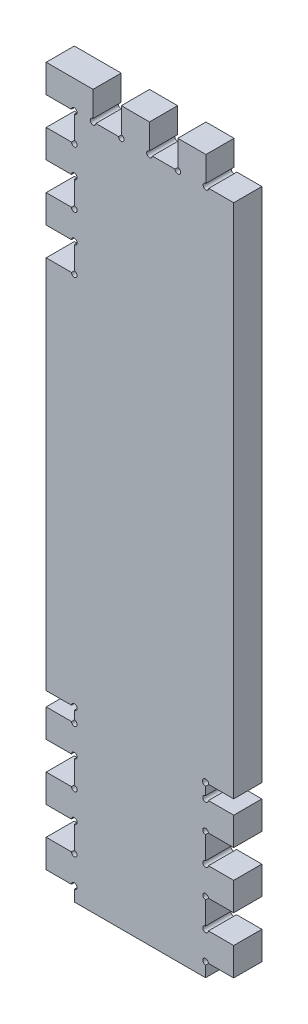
ISO-10303-21;
HEADER;
FILE_DESCRIPTION(('STEP AP214'),'2;1');
FILE_NAME('part.step','',(''),(''),'','','');
FILE_SCHEMA(('AUTOMOTIVE_DESIGN { 1 0 10303 214 1 1 1 1 }'));
ENDSEC;
DATA;
#1=APPLICATION_CONTEXT('core data for automotive mechanical design processes');
#2=APPLICATION_PROTOCOL_DEFINITION('international standard','automotive_design',2000,#1);
#3=PRODUCT_CONTEXT('',#1,'mechanical');
#4=PRODUCT('Part','Part','',(#3));
#5=PRODUCT_RELATED_PRODUCT_CATEGORY('part','',(#4));
#6=PRODUCT_DEFINITION_FORMATION('','',#4);
#7=PRODUCT_DEFINITION_CONTEXT('part definition',#1,'design');
#8=PRODUCT_DEFINITION('design','',#6,#7);
#9=PRODUCT_DEFINITION_SHAPE('','',#8);
#10=(LENGTH_UNIT() NAMED_UNIT(*) SI_UNIT(.MILLI.,.METRE.));
#11=(NAMED_UNIT(*) PLANE_ANGLE_UNIT() SI_UNIT($,.RADIAN.));
#12=(NAMED_UNIT(*) SI_UNIT($,.STERADIAN.) SOLID_ANGLE_UNIT());
#13=UNCERTAINTY_MEASURE_WITH_UNIT(LENGTH_MEASURE(1.E-05),#10,'distance_accuracy_value','');
#14=(GEOMETRIC_REPRESENTATION_CONTEXT(3) GLOBAL_UNCERTAINTY_ASSIGNED_CONTEXT((#13)) GLOBAL_UNIT_ASSIGNED_CONTEXT((#10,
#11,#12)) REPRESENTATION_CONTEXT('',''));
#15=CARTESIAN_POINT('',(0.,0.,0.));
#16=DIRECTION('',(0.,0.,1.));
#17=DIRECTION('',(1.,0.,0.));
#18=AXIS2_PLACEMENT_3D('',#15,#16,#17);
#19=CARTESIAN_POINT('',(15.,82.6,15.));
#20=DIRECTION('',(0.,0.,-1.));
#21=DIRECTION('',(-1.,0.,0.));
#22=AXIS2_PLACEMENT_3D('',#19,#20,#21);
#23=CYLINDRICAL_SURFACE('',#22,1.5);
#24=CARTESIAN_POINT('',(15.,82.6,0.));
#25=DIRECTION('',(0.,0.,-1.));
#26=DIRECTION('',(1.,0.,0.));
#27=AXIS2_PLACEMENT_3D('',#24,#25,#26);
#28=CIRCLE('',#27,1.5);
#29=CARTESIAN_POINT('',(15.,84.1,0.));
#30=VERTEX_POINT('',#29);
#31=CARTESIAN_POINT('',(13.5,82.6,0.));
#32=VERTEX_POINT('',#31);
#33=EDGE_CURVE('E571',#30,#32,#28,.T.);
#34=ORIENTED_EDGE('',*,*,#33,.T.);
#35=DIRECTION('',(0.,0.,-1.));
#36=VECTOR('',#35,1.);
#37=CARTESIAN_POINT('',(13.5,82.6,15.));
#38=LINE('',#37,#36);
#39=CARTESIAN_POINT('',(13.5,82.6,15.));
#40=VERTEX_POINT('',#39);
#41=EDGE_CURVE('E11',#40,#32,#38,.T.);
#42=ORIENTED_EDGE('',*,*,#41,.F.);
#43=CARTESIAN_POINT('',(15.,82.6,15.));
#44=DIRECTION('',(0.,0.,-1.));
#45=DIRECTION('',(1.,0.,0.));
#46=AXIS2_PLACEMENT_3D('',#43,#44,#45);
#47=CIRCLE('',#46,1.5);
#48=CARTESIAN_POINT('',(15.,84.1,15.));
#49=VERTEX_POINT('',#48);
#50=EDGE_CURVE('E733',#49,#40,#47,.T.);
#51=ORIENTED_EDGE('',*,*,#50,.F.);
#52=DIRECTION('',(0.,0.,-1.));
#53=VECTOR('',#52,1.);
#54=CARTESIAN_POINT('',(15.,84.1,15.));
#55=LINE('',#54,#53);
#56=EDGE_CURVE('E567',#49,#30,#55,.T.);
#57=ORIENTED_EDGE('',*,*,#56,.T.);
#58=EDGE_LOOP('',(#34,#42,#51,#57));
#59=FACE_BOUND('',#58,.T.);
#60=ADVANCED_FACE('F41',(#59),#23,.F.);
#61=CARTESIAN_POINT('',(0.,82.6,15.));
#62=DIRECTION('',(0.,-1.,0.));
#63=DIRECTION('',(0.,0.,-1.));
#64=AXIS2_PLACEMENT_3D('',#61,#62,#63);
#65=PLANE('',#64);
#66=DIRECTION('',(-1.,0.,0.));
#67=VECTOR('',#66,1.);
#68=CARTESIAN_POINT('',(0.,82.6,0.));
#69=LINE('',#68,#67);
#70=CARTESIAN_POINT('',(0.,82.6,0.));
#71=VERTEX_POINT('',#70);
#72=EDGE_CURVE('E574',#32,#71,#69,.T.);
#73=ORIENTED_EDGE('',*,*,#72,.T.);
#74=DIRECTION('',(0.,0.,-1.));
#75=VECTOR('',#74,1.);
#76=CARTESIAN_POINT('',(0.,82.6,15.));
#77=LINE('',#76,#75);
#78=CARTESIAN_POINT('',(0.,82.6,15.));
#79=VERTEX_POINT('',#78);
#80=EDGE_CURVE('E49',#79,#71,#77,.T.);
#81=ORIENTED_EDGE('',*,*,#80,.F.);
#82=DIRECTION('',(-1.,0.,0.));
#83=VECTOR('',#82,1.);
#84=CARTESIAN_POINT('',(0.,82.6,15.));
#85=LINE('',#84,#83);
#86=EDGE_CURVE('E317',#40,#79,#85,.T.);
#87=ORIENTED_EDGE('',*,*,#86,.F.);
#88=ORIENTED_EDGE('',*,*,#41,.T.);
#89=EDGE_LOOP('',(#73,#81,#87,#88));
#90=FACE_BOUND('',#89,.T.);
#91=ADVANCED_FACE('F1156',(#90),#65,.F.);
#92=CARTESIAN_POINT('',(0.,82.6,15.));
#93=DIRECTION('',(1.,0.,0.));
#94=DIRECTION('',(0.,0.,-1.));
#95=AXIS2_PLACEMENT_3D('',#92,#93,#94);
#96=PLANE('',#95);
#97=DIRECTION('',(0.,-1.,0.));
#98=VECTOR('',#97,1.);
#99=CARTESIAN_POINT('',(0.,82.6,0.));
#100=LINE('',#99,#98);
#101=CARTESIAN_POINT('',(0.,67.6,0.));
#102=VERTEX_POINT('',#101);
#103=EDGE_CURVE('E576',#71,#102,#100,.T.);
#104=ORIENTED_EDGE('',*,*,#103,.T.);
#105=DIRECTION('',(0.,0.,-1.));
#106=VECTOR('',#105,1.);
#107=CARTESIAN_POINT('',(0.,67.6,15.));
#108=LINE('',#107,#106);
#109=CARTESIAN_POINT('',(0.,67.6,15.));
#110=VERTEX_POINT('',#109);
#111=EDGE_CURVE('E957',#110,#102,#108,.T.);
#112=ORIENTED_EDGE('',*,*,#111,.F.);
#113=DIRECTION('',(0.,-1.,0.));
#114=VECTOR('',#113,1.);
#115=CARTESIAN_POINT('',(0.,82.6,15.));
#116=LINE('',#115,#114);
#117=EDGE_CURVE('E965',#79,#110,#116,.T.);
#118=ORIENTED_EDGE('',*,*,#117,.F.);
#119=ORIENTED_EDGE('',*,*,#80,.T.);
#120=EDGE_LOOP('',(#104,#112,#118,#119));
#121=FACE_BOUND('',#120,.T.);
#122=ADVANCED_FACE('F963',(#121),#96,.F.);
#123=CARTESIAN_POINT('',(0.,67.6,15.));
#124=DIRECTION('',(0.,1.,0.));
#125=DIRECTION('',(0.,0.,1.));
#126=AXIS2_PLACEMENT_3D('',#123,#124,#125);
#127=PLANE('',#126);
#128=DIRECTION('',(1.,0.,0.));
#129=VECTOR('',#128,1.);
#130=CARTESIAN_POINT('',(0.,67.6,0.));
#131=LINE('',#130,#129);
#132=CARTESIAN_POINT('',(13.5,67.6,0.));
#133=VERTEX_POINT('',#132);
#134=EDGE_CURVE('E578',#102,#133,#131,.T.);
#135=ORIENTED_EDGE('',*,*,#134,.T.);
#136=DIRECTION('',(0.,0.,-1.));
#137=VECTOR('',#136,1.);
#138=CARTESIAN_POINT('',(13.5,67.6,15.));
#139=LINE('',#138,#137);
#140=CARTESIAN_POINT('',(13.5,67.6,15.));
#141=VERTEX_POINT('',#140);
#142=EDGE_CURVE('E954',#141,#133,#139,.T.);
#143=ORIENTED_EDGE('',*,*,#142,.F.);
#144=DIRECTION('',(1.,0.,0.));
#145=VECTOR('',#144,1.);
#146=CARTESIAN_POINT('',(0.,67.6,15.));
#147=LINE('',#146,#145);
#148=EDGE_CURVE('E983',#110,#141,#147,.T.);
#149=ORIENTED_EDGE('',*,*,#148,.F.);
#150=ORIENTED_EDGE('',*,*,#111,.T.);
#151=EDGE_LOOP('',(#135,#143,#149,#150));
#152=FACE_BOUND('',#151,.T.);
#153=ADVANCED_FACE('F974',(#152),#127,.F.);
#154=CARTESIAN_POINT('',(15.,67.6,15.));
#155=DIRECTION('',(0.,0.,-1.));
#156=DIRECTION('',(-1.,0.,0.));
#157=AXIS2_PLACEMENT_3D('',#154,#155,#156);
#158=CYLINDRICAL_SURFACE('',#157,1.5);
#159=CARTESIAN_POINT('',(15.,67.6,0.));
#160=DIRECTION('',(0.,0.,-1.));
#161=DIRECTION('',(-1.,0.,0.));
#162=AXIS2_PLACEMENT_3D('',#159,#160,#161);
#163=CIRCLE('',#162,1.5);
#164=CARTESIAN_POINT('',(15.,66.1,0.));
#165=VERTEX_POINT('',#164);
#166=EDGE_CURVE('E580',#133,#165,#163,.T.);
#167=ORIENTED_EDGE('',*,*,#166,.T.);
#168=DIRECTION('',(0.,0.,-1.));
#169=VECTOR('',#168,1.);
#170=CARTESIAN_POINT('',(15.,66.1,15.));
#171=LINE('',#170,#169);
#172=CARTESIAN_POINT('',(15.,66.1,15.));
#173=VERTEX_POINT('',#172);
#174=EDGE_CURVE('E951',#173,#165,#171,.T.);
#175=ORIENTED_EDGE('',*,*,#174,.F.);
#176=CARTESIAN_POINT('',(15.,67.6,15.));
#177=DIRECTION('',(0.,0.,-1.));
#178=DIRECTION('',(-1.,0.,0.));
#179=AXIS2_PLACEMENT_3D('',#176,#177,#178);
#180=CIRCLE('',#179,1.5);
#181=EDGE_CURVE('E980',#141,#173,#180,.T.);
#182=ORIENTED_EDGE('',*,*,#181,.F.);
#183=ORIENTED_EDGE('',*,*,#142,.T.);
#184=EDGE_LOOP('',(#167,#175,#182,#183));
#185=FACE_BOUND('',#184,.T.);
#186=ADVANCED_FACE('F978',(#185),#158,.F.);
#187=CARTESIAN_POINT('',(15.,66.1,15.));
#188=DIRECTION('',(1.,0.,0.));
#189=DIRECTION('',(0.,1.,0.));
#190=AXIS2_PLACEMENT_3D('',#187,#188,#189);
#191=PLANE('',#190);
#192=DIRECTION('',(0.,-1.,0.));
#193=VECTOR('',#192,1.);
#194=CARTESIAN_POINT('',(15.,66.1,0.));
#195=LINE('',#194,#193);
#196=CARTESIAN_POINT('',(15.,54.,0.));
#197=VERTEX_POINT('',#196);
#198=EDGE_CURVE('E582',#165,#197,#195,.T.);
#199=ORIENTED_EDGE('',*,*,#198,.T.);
#200=DIRECTION('',(0.,0.,-1.));
#201=VECTOR('',#200,1.);
#202=CARTESIAN_POINT('',(15.,54.,15.));
#203=LINE('',#202,#201);
#204=CARTESIAN_POINT('',(15.,54.,15.));
#205=VERTEX_POINT('',#204);
#206=EDGE_CURVE('E948',#205,#197,#203,.T.);
#207=ORIENTED_EDGE('',*,*,#206,.F.);
#208=DIRECTION('',(0.,-1.,0.));
#209=VECTOR('',#208,1.);
#210=CARTESIAN_POINT('',(15.,66.1,15.));
#211=LINE('',#210,#209);
#212=EDGE_CURVE('E982',#173,#205,#211,.T.);
#213=ORIENTED_EDGE('',*,*,#212,.F.);
#214=ORIENTED_EDGE('',*,*,#174,.T.);
#215=EDGE_LOOP('',(#199,#207,#213,#214));
#216=FACE_BOUND('',#215,.T.);
#217=ADVANCED_FACE('F1169',(#216),#191,.F.);
#218=CARTESIAN_POINT('',(15.,52.5,15.));
#219=DIRECTION('',(0.,0.,-1.));
#220=DIRECTION('',(-1.,0.,0.));
#221=AXIS2_PLACEMENT_3D('',#218,#219,#220);
#222=CYLINDRICAL_SURFACE('',#221,1.5);
#223=CARTESIAN_POINT('',(15.,52.5,0.));
#224=DIRECTION('',(0.,0.,-1.));
#225=DIRECTION('',(-1.,0.,0.));
#226=AXIS2_PLACEMENT_3D('',#223,#224,#225);
#227=CIRCLE('',#226,1.5);
#228=CARTESIAN_POINT('',(13.5,52.5,0.));
#229=VERTEX_POINT('',#228);
#230=EDGE_CURVE('E584',#197,#229,#227,.T.);
#231=ORIENTED_EDGE('',*,*,#230,.T.);
#232=DIRECTION('',(0.,0.,-1.));
#233=VECTOR('',#232,1.);
#234=CARTESIAN_POINT('',(13.5,52.5,15.));
#235=LINE('',#234,#233);
#236=CARTESIAN_POINT('',(13.5,52.5,15.));
#237=VERTEX_POINT('',#236);
#238=EDGE_CURVE('E945',#237,#229,#235,.T.);
#239=ORIENTED_EDGE('',*,*,#238,.F.);
#240=CARTESIAN_POINT('',(15.,52.5,15.));
#241=DIRECTION('',(0.,0.,-1.));
#242=DIRECTION('',(-1.,0.,0.));
#243=AXIS2_PLACEMENT_3D('',#240,#241,#242);
#244=CIRCLE('',#243,1.5);
#245=EDGE_CURVE('E985',#205,#237,#244,.T.);
#246=ORIENTED_EDGE('',*,*,#245,.F.);
#247=ORIENTED_EDGE('',*,*,#206,.T.);
#248=EDGE_LOOP('',(#231,#239,#246,#247));
#249=FACE_BOUND('',#248,.T.);
#250=ADVANCED_FACE('F1172',(#249),#222,.F.);
#251=CARTESIAN_POINT('',(13.5,52.5,15.));
#252=DIRECTION('',(0.,-1.,0.));
#253=DIRECTION('',(0.,0.,-1.));
#254=AXIS2_PLACEMENT_3D('',#251,#252,#253);
#255=PLANE('',#254);
#256=DIRECTION('',(-1.,0.,0.));
#257=VECTOR('',#256,1.);
#258=CARTESIAN_POINT('',(13.5,52.5,0.));
#259=LINE('',#258,#257);
#260=CARTESIAN_POINT('',(0.,52.5,0.));
#261=VERTEX_POINT('',#260);
#262=EDGE_CURVE('E586',#229,#261,#259,.T.);
#263=ORIENTED_EDGE('',*,*,#262,.T.);
#264=DIRECTION('',(0.,0.,-1.));
#265=VECTOR('',#264,1.);
#266=CARTESIAN_POINT('',(0.,52.5,15.));
#267=LINE('',#266,#265);
#268=CARTESIAN_POINT('',(0.,52.5,15.));
#269=VERTEX_POINT('',#268);
#270=EDGE_CURVE('E942',#269,#261,#267,.T.);
#271=ORIENTED_EDGE('',*,*,#270,.F.);
#272=DIRECTION('',(-1.,0.,0.));
#273=VECTOR('',#272,1.);
#274=CARTESIAN_POINT('',(13.5,52.5,15.));
#275=LINE('',#274,#273);
#276=EDGE_CURVE('E991',#237,#269,#275,.T.);
#277=ORIENTED_EDGE('',*,*,#276,.F.);
#278=ORIENTED_EDGE('',*,*,#238,.T.);
#279=EDGE_LOOP('',(#263,#271,#277,#278));
#280=FACE_BOUND('',#279,.T.);
#281=ADVANCED_FACE('F1176',(#280),#255,.F.);
#282=CARTESIAN_POINT('',(0.,52.5,15.));
#283=DIRECTION('',(1.,0.,0.));
#284=DIRECTION('',(0.,0.,-1.));
#285=AXIS2_PLACEMENT_3D('',#282,#283,#284);
#286=PLANE('',#285);
#287=DIRECTION('',(0.,-1.,0.));
#288=VECTOR('',#287,1.);
#289=CARTESIAN_POINT('',(0.,52.5,0.));
#290=LINE('',#289,#288);
#291=CARTESIAN_POINT('',(0.,37.5,0.));
#292=VERTEX_POINT('',#291);
#293=EDGE_CURVE('E588',#261,#292,#290,.T.);
#294=ORIENTED_EDGE('',*,*,#293,.T.);
#295=DIRECTION('',(0.,0.,-1.));
#296=VECTOR('',#295,1.);
#297=CARTESIAN_POINT('',(0.,37.5,15.));
#298=LINE('',#297,#296);
#299=CARTESIAN_POINT('',(0.,37.5,15.));
#300=VERTEX_POINT('',#299);
#301=EDGE_CURVE('E939',#300,#292,#298,.T.);
#302=ORIENTED_EDGE('',*,*,#301,.F.);
#303=DIRECTION('',(0.,-1.,0.));
#304=VECTOR('',#303,1.);
#305=CARTESIAN_POINT('',(0.,52.5,15.));
#306=LINE('',#305,#304);
#307=EDGE_CURVE('E993',#269,#300,#306,.T.);
#308=ORIENTED_EDGE('',*,*,#307,.F.);
#309=ORIENTED_EDGE('',*,*,#270,.T.);
#310=EDGE_LOOP('',(#294,#302,#308,#309));
#311=FACE_BOUND('',#310,.T.);
#312=ADVANCED_FACE('F1180',(#311),#286,.F.);
#313=CARTESIAN_POINT('',(0.,37.5,15.));
#314=DIRECTION('',(0.,1.,0.));
#315=DIRECTION('',(0.,0.,1.));
#316=AXIS2_PLACEMENT_3D('',#313,#314,#315);
#317=PLANE('',#316);
#318=DIRECTION('',(1.,0.,0.));
#319=VECTOR('',#318,1.);
#320=CARTESIAN_POINT('',(0.,37.5,0.));
#321=LINE('',#320,#319);
#322=CARTESIAN_POINT('',(13.5,37.5,0.));
#323=VERTEX_POINT('',#322);
#324=EDGE_CURVE('E590',#292,#323,#321,.T.);
#325=ORIENTED_EDGE('',*,*,#324,.T.);
#326=DIRECTION('',(0.,0.,-1.));
#327=VECTOR('',#326,1.);
#328=CARTESIAN_POINT('',(13.5,37.5,15.));
#329=LINE('',#328,#327);
#330=CARTESIAN_POINT('',(13.5,37.5,15.));
#331=VERTEX_POINT('',#330);
#332=EDGE_CURVE('E936',#331,#323,#329,.T.);
#333=ORIENTED_EDGE('',*,*,#332,.F.);
#334=DIRECTION('',(1.,0.,0.));
#335=VECTOR('',#334,1.);
#336=CARTESIAN_POINT('',(0.,37.5,15.));
#337=LINE('',#336,#335);
#338=EDGE_CURVE('E995',#300,#331,#337,.T.);
#339=ORIENTED_EDGE('',*,*,#338,.F.);
#340=ORIENTED_EDGE('',*,*,#301,.T.);
#341=EDGE_LOOP('',(#325,#333,#339,#340));
#342=FACE_BOUND('',#341,.T.);
#343=ADVANCED_FACE('F1184',(#342),#317,.F.);
#344=CARTESIAN_POINT('',(15.,37.5,15.));
#345=DIRECTION('',(0.,0.,-1.));
#346=DIRECTION('',(-1.,0.,0.));
#347=AXIS2_PLACEMENT_3D('',#344,#345,#346);
#348=CYLINDRICAL_SURFACE('',#347,1.5);
#349=CARTESIAN_POINT('',(15.,37.5,0.));
#350=DIRECTION('',(0.,0.,-1.));
#351=DIRECTION('',(-1.,0.,0.));
#352=AXIS2_PLACEMENT_3D('',#349,#350,#351);
#353=CIRCLE('',#352,1.5);
#354=CARTESIAN_POINT('',(15.,36.,0.));
#355=VERTEX_POINT('',#354);
#356=EDGE_CURVE('E592',#323,#355,#353,.T.);
#357=ORIENTED_EDGE('',*,*,#356,.T.);
#358=DIRECTION('',(0.,0.,-1.));
#359=VECTOR('',#358,1.);
#360=CARTESIAN_POINT('',(15.,36.,15.));
#361=LINE('',#360,#359);
#362=CARTESIAN_POINT('',(15.,36.,15.));
#363=VERTEX_POINT('',#362);
#364=EDGE_CURVE('E933',#363,#355,#361,.T.);
#365=ORIENTED_EDGE('',*,*,#364,.F.);
#366=CARTESIAN_POINT('',(15.,37.5,15.));
#367=DIRECTION('',(0.,0.,-1.));
#368=DIRECTION('',(-1.,0.,0.));
#369=AXIS2_PLACEMENT_3D('',#366,#367,#368);
#370=CIRCLE('',#369,1.5);
#371=EDGE_CURVE('E997',#331,#363,#370,.T.);
#372=ORIENTED_EDGE('',*,*,#371,.F.);
#373=ORIENTED_EDGE('',*,*,#332,.T.);
#374=EDGE_LOOP('',(#357,#365,#372,#373));
#375=FACE_BOUND('',#374,.T.);
#376=ADVANCED_FACE('F1188',(#375),#348,.F.);
#377=CARTESIAN_POINT('',(15.,36.,15.));
#378=DIRECTION('',(1.,0.,0.));
#379=DIRECTION('',(0.,0.,-1.));
#380=AXIS2_PLACEMENT_3D('',#377,#378,#379);
#381=PLANE('',#380);
#382=DIRECTION('',(0.,-1.,0.));
#383=VECTOR('',#382,1.);
#384=CARTESIAN_POINT('',(15.,36.,0.));
#385=LINE('',#384,#383);
#386=CARTESIAN_POINT('',(15.,23.9,0.));
#387=VERTEX_POINT('',#386);
#388=EDGE_CURVE('E594',#355,#387,#385,.T.);
#389=ORIENTED_EDGE('',*,*,#388,.T.);
#390=DIRECTION('',(0.,0.,-1.));
#391=VECTOR('',#390,1.);
#392=CARTESIAN_POINT('',(15.,23.9,15.));
#393=LINE('',#392,#391);
#394=CARTESIAN_POINT('',(15.,23.9,15.));
#395=VERTEX_POINT('',#394);
#396=EDGE_CURVE('E930',#395,#387,#393,.T.);
#397=ORIENTED_EDGE('',*,*,#396,.F.);
#398=DIRECTION('',(0.,-1.,0.));
#399=VECTOR('',#398,1.);
#400=CARTESIAN_POINT('',(15.,36.,15.));
#401=LINE('',#400,#399);
#402=EDGE_CURVE('E999',#363,#395,#401,.T.);
#403=ORIENTED_EDGE('',*,*,#402,.F.);
#404=ORIENTED_EDGE('',*,*,#364,.T.);
#405=EDGE_LOOP('',(#389,#397,#403,#404));
#406=FACE_BOUND('',#405,.T.);
#407=ADVANCED_FACE('F1192',(#406),#381,.F.);
#408=CARTESIAN_POINT('',(15.,22.4,15.));
#409=DIRECTION('',(0.,0.,-1.));
#410=DIRECTION('',(-1.,0.,0.));
#411=AXIS2_PLACEMENT_3D('',#408,#409,#410);
#412=CYLINDRICAL_SURFACE('',#411,1.49999999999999);
#413=CARTESIAN_POINT('',(15.,22.4,0.));
#414=DIRECTION('',(0.,0.,-1.));
#415=DIRECTION('',(-1.,0.,0.));
#416=AXIS2_PLACEMENT_3D('',#413,#414,#415);
#417=CIRCLE('',#416,1.49999999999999);
#418=CARTESIAN_POINT('',(13.5,22.4,0.));
#419=VERTEX_POINT('',#418);
#420=EDGE_CURVE('E596',#387,#419,#417,.T.);
#421=ORIENTED_EDGE('',*,*,#420,.T.);
#422=DIRECTION('',(0.,0.,-1.));
#423=VECTOR('',#422,1.);
#424=CARTESIAN_POINT('',(13.5,22.4,15.));
#425=LINE('',#424,#423);
#426=CARTESIAN_POINT('',(13.5,22.4,15.));
#427=VERTEX_POINT('',#426);
#428=EDGE_CURVE('E927',#427,#419,#425,.T.);
#429=ORIENTED_EDGE('',*,*,#428,.F.);
#430=CARTESIAN_POINT('',(15.,22.4,15.));
#431=DIRECTION('',(0.,0.,-1.));
#432=DIRECTION('',(-1.,0.,0.));
#433=AXIS2_PLACEMENT_3D('',#430,#431,#432);
#434=CIRCLE('',#433,1.49999999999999);
#435=EDGE_CURVE('E1001',#395,#427,#434,.T.);
#436=ORIENTED_EDGE('',*,*,#435,.F.);
#437=ORIENTED_EDGE('',*,*,#396,.T.);
#438=EDGE_LOOP('',(#421,#429,#436,#437));
#439=FACE_BOUND('',#438,.T.);
#440=ADVANCED_FACE('F1196',(#439),#412,.F.);
#441=CARTESIAN_POINT('',(13.5,22.4,15.));
#442=DIRECTION('',(0.,-1.,0.));
#443=DIRECTION('',(0.,0.,-1.));
#444=AXIS2_PLACEMENT_3D('',#441,#442,#443);
#445=PLANE('',#444);
#446=DIRECTION('',(-1.,0.,0.));
#447=VECTOR('',#446,1.);
#448=CARTESIAN_POINT('',(13.5,22.4,0.));
#449=LINE('',#448,#447);
#450=CARTESIAN_POINT('',(0.,22.4,0.));
#451=VERTEX_POINT('',#450);
#452=EDGE_CURVE('E598',#419,#451,#449,.T.);
#453=ORIENTED_EDGE('',*,*,#452,.T.);
#454=DIRECTION('',(0.,0.,-1.));
#455=VECTOR('',#454,1.);
#456=CARTESIAN_POINT('',(0.,22.4,15.));
#457=LINE('',#456,#455);
#458=CARTESIAN_POINT('',(0.,22.4,15.));
#459=VERTEX_POINT('',#458);
#460=EDGE_CURVE('E924',#459,#451,#457,.T.);
#461=ORIENTED_EDGE('',*,*,#460,.F.);
#462=DIRECTION('',(-1.,0.,0.));
#463=VECTOR('',#462,1.);
#464=CARTESIAN_POINT('',(13.5,22.4,15.));
#465=LINE('',#464,#463);
#466=EDGE_CURVE('E1003',#427,#459,#465,.T.);
#467=ORIENTED_EDGE('',*,*,#466,.F.);
#468=ORIENTED_EDGE('',*,*,#428,.T.);
#469=EDGE_LOOP('',(#453,#461,#467,#468));
#470=FACE_BOUND('',#469,.T.);
#471=ADVANCED_FACE('F1200',(#470),#445,.F.);
#472=CARTESIAN_POINT('',(0.,22.4,15.));
#473=DIRECTION('',(1.,0.,0.));
#474=DIRECTION('',(0.,0.,-1.));
#475=AXIS2_PLACEMENT_3D('',#472,#473,#474);
#476=PLANE('',#475);
#477=DIRECTION('',(0.,-1.,0.));
#478=VECTOR('',#477,1.);
#479=CARTESIAN_POINT('',(0.,22.4,0.));
#480=LINE('',#479,#478);
#481=CARTESIAN_POINT('',(0.,7.4,0.));
#482=VERTEX_POINT('',#481);
#483=EDGE_CURVE('E600',#451,#482,#480,.T.);
#484=ORIENTED_EDGE('',*,*,#483,.T.);
#485=DIRECTION('',(0.,0.,-1.));
#486=VECTOR('',#485,1.);
#487=CARTESIAN_POINT('',(0.,7.4,15.));
#488=LINE('',#487,#486);
#489=CARTESIAN_POINT('',(0.,7.4,15.));
#490=VERTEX_POINT('',#489);
#491=EDGE_CURVE('E921',#490,#482,#488,.T.);
#492=ORIENTED_EDGE('',*,*,#491,.F.);
#493=DIRECTION('',(0.,-1.,0.));
#494=VECTOR('',#493,1.);
#495=CARTESIAN_POINT('',(0.,22.4,15.));
#496=LINE('',#495,#494);
#497=EDGE_CURVE('E1005',#459,#490,#496,.T.);
#498=ORIENTED_EDGE('',*,*,#497,.F.);
#499=ORIENTED_EDGE('',*,*,#460,.T.);
#500=EDGE_LOOP('',(#484,#492,#498,#499));
#501=FACE_BOUND('',#500,.T.);
#502=ADVANCED_FACE('F1204',(#501),#476,.F.);
#503=CARTESIAN_POINT('',(0.,7.4,15.));
#504=DIRECTION('',(0.,1.,0.));
#505=DIRECTION('',(0.,0.,1.));
#506=AXIS2_PLACEMENT_3D('',#503,#504,#505);
#507=PLANE('',#506);
#508=DIRECTION('',(1.,0.,0.));
#509=VECTOR('',#508,1.);
#510=CARTESIAN_POINT('',(0.,7.4,0.));
#511=LINE('',#510,#509);
#512=CARTESIAN_POINT('',(13.5,7.4,0.));
#513=VERTEX_POINT('',#512);
#514=EDGE_CURVE('E602',#482,#513,#511,.T.);
#515=ORIENTED_EDGE('',*,*,#514,.T.);
#516=DIRECTION('',(0.,0.,-1.));
#517=VECTOR('',#516,1.);
#518=CARTESIAN_POINT('',(13.5,7.4,15.));
#519=LINE('',#518,#517);
#520=CARTESIAN_POINT('',(13.5,7.4,15.));
#521=VERTEX_POINT('',#520);
#522=EDGE_CURVE('E918',#521,#513,#519,.T.);
#523=ORIENTED_EDGE('',*,*,#522,.F.);
#524=DIRECTION('',(1.,0.,0.));
#525=VECTOR('',#524,1.);
#526=CARTESIAN_POINT('',(0.,7.4,15.));
#527=LINE('',#526,#525);
#528=EDGE_CURVE('E1007',#490,#521,#527,.T.);
#529=ORIENTED_EDGE('',*,*,#528,.F.);
#530=ORIENTED_EDGE('',*,*,#491,.T.);
#531=EDGE_LOOP('',(#515,#523,#529,#530));
#532=FACE_BOUND('',#531,.T.);
#533=ADVANCED_FACE('F1208',(#532),#507,.F.);
#534=CARTESIAN_POINT('',(15.,7.4,15.));
#535=DIRECTION('',(0.,0.,-1.));
#536=DIRECTION('',(-1.,0.,0.));
#537=AXIS2_PLACEMENT_3D('',#534,#535,#536);
#538=CYLINDRICAL_SURFACE('',#537,1.5);
#539=CARTESIAN_POINT('',(15.,7.4,0.));
#540=DIRECTION('',(0.,0.,-1.));
#541=DIRECTION('',(-1.,0.,0.));
#542=AXIS2_PLACEMENT_3D('',#539,#540,#541);
#543=CIRCLE('',#542,1.5);
#544=CARTESIAN_POINT('',(15.,5.9,0.));
#545=VERTEX_POINT('',#544);
#546=EDGE_CURVE('E604',#513,#545,#543,.T.);
#547=ORIENTED_EDGE('',*,*,#546,.T.);
#548=DIRECTION('',(0.,0.,-1.));
#549=VECTOR('',#548,1.);
#550=CARTESIAN_POINT('',(15.,5.9,15.));
#551=LINE('',#550,#549);
#552=CARTESIAN_POINT('',(15.,5.9,15.));
#553=VERTEX_POINT('',#552);
#554=EDGE_CURVE('E915',#553,#545,#551,.T.);
#555=ORIENTED_EDGE('',*,*,#554,.F.);
#556=CARTESIAN_POINT('',(15.,7.4,15.));
#557=DIRECTION('',(0.,0.,-1.));
#558=DIRECTION('',(-1.,0.,0.));
#559=AXIS2_PLACEMENT_3D('',#556,#557,#558);
#560=CIRCLE('',#559,1.5);
#561=EDGE_CURVE('E1009',#521,#553,#560,.T.);
#562=ORIENTED_EDGE('',*,*,#561,.F.);
#563=ORIENTED_EDGE('',*,*,#522,.T.);
#564=EDGE_LOOP('',(#547,#555,#562,#563));
#565=FACE_BOUND('',#564,.T.);
#566=ADVANCED_FACE('F1212',(#565),#538,.F.);
#567=CARTESIAN_POINT('',(15.,5.9,15.));
#568=DIRECTION('',(1.,0.,0.));
#569=DIRECTION('',(0.,0.,-1.));
#570=AXIS2_PLACEMENT_3D('',#567,#568,#569);
#571=PLANE('',#570);
#572=DIRECTION('',(0.,-1.,0.));
#573=VECTOR('',#572,1.);
#574=CARTESIAN_POINT('',(15.,5.9,0.));
#575=LINE('',#574,#573);
#576=CARTESIAN_POINT('',(15.,0.,0.));
#577=VERTEX_POINT('',#576);
#578=EDGE_CURVE('E606',#545,#577,#575,.T.);
#579=ORIENTED_EDGE('',*,*,#578,.T.);
#580=DIRECTION('',(0.,0.,-1.));
#581=VECTOR('',#580,1.);
#582=CARTESIAN_POINT('',(15.,0.,15.));
#583=LINE('',#582,#581);
#584=CARTESIAN_POINT('',(15.,0.,15.));
#585=VERTEX_POINT('',#584);
#586=EDGE_CURVE('E912',#585,#577,#583,.T.);
#587=ORIENTED_EDGE('',*,*,#586,.F.);
#588=DIRECTION('',(0.,-1.,0.));
#589=VECTOR('',#588,1.);
#590=CARTESIAN_POINT('',(15.,5.9,15.));
#591=LINE('',#590,#589);
#592=EDGE_CURVE('E1011',#553,#585,#591,.T.);
#593=ORIENTED_EDGE('',*,*,#592,.F.);
#594=ORIENTED_EDGE('',*,*,#554,.T.);
#595=EDGE_LOOP('',(#579,#587,#593,#594));
#596=FACE_BOUND('',#595,.T.);
#597=ADVANCED_FACE('F1216',(#596),#571,.F.);
#598=CARTESIAN_POINT('',(85.,0.,15.));
#599=DIRECTION('',(0.,1.,0.));
#600=DIRECTION('',(0.,0.,1.));
#601=AXIS2_PLACEMENT_3D('',#598,#599,#600);
#602=PLANE('',#601);
#603=DIRECTION('',(1.,0.,0.));
#604=VECTOR('',#603,1.);
#605=CARTESIAN_POINT('',(85.,0.,0.));
#606=LINE('',#605,#604);
#607=CARTESIAN_POINT('',(85.,0.,0.));
#608=VERTEX_POINT('',#607);
#609=EDGE_CURVE('E608',#577,#608,#606,.T.);
#610=ORIENTED_EDGE('',*,*,#609,.T.);
#611=DIRECTION('',(0.,0.,-1.));
#612=VECTOR('',#611,1.);
#613=CARTESIAN_POINT('',(85.,0.,15.));
#614=LINE('',#613,#612);
#615=CARTESIAN_POINT('',(85.,0.,15.));
#616=VERTEX_POINT('',#615);
#617=EDGE_CURVE('E909',#616,#608,#614,.T.);
#618=ORIENTED_EDGE('',*,*,#617,.F.);
#619=DIRECTION('',(1.,0.,0.));
#620=VECTOR('',#619,1.);
#621=CARTESIAN_POINT('',(85.,0.,15.));
#622=LINE('',#621,#620);
#623=EDGE_CURVE('E1013',#585,#616,#622,.T.);
#624=ORIENTED_EDGE('',*,*,#623,.F.);
#625=ORIENTED_EDGE('',*,*,#586,.T.);
#626=EDGE_LOOP('',(#610,#618,#624,#625));
#627=FACE_BOUND('',#626,.T.);
#628=ADVANCED_FACE('F1220',(#627),#602,.F.);
#629=CARTESIAN_POINT('',(85.,5.89999999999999,15.));
#630=DIRECTION('',(-1.,0.,0.));
#631=DIRECTION('',(0.,-1.,0.));
#632=AXIS2_PLACEMENT_3D('',#629,#630,#631);
#633=PLANE('',#632);
#634=DIRECTION('',(0.,1.,0.));
#635=VECTOR('',#634,1.);
#636=CARTESIAN_POINT('',(85.,5.89999999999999,0.));
#637=LINE('',#636,#635);
#638=CARTESIAN_POINT('',(85.,5.89999999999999,0.));
#639=VERTEX_POINT('',#638);
#640=EDGE_CURVE('E610',#608,#639,#637,.T.);
#641=ORIENTED_EDGE('',*,*,#640,.T.);
#642=DIRECTION('',(0.,0.,-1.));
#643=VECTOR('',#642,1.);
#644=CARTESIAN_POINT('',(85.,5.89999999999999,15.));
#645=LINE('',#644,#643);
#646=CARTESIAN_POINT('',(85.,5.89999999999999,15.));
#647=VERTEX_POINT('',#646);
#648=EDGE_CURVE('E906',#647,#639,#645,.T.);
#649=ORIENTED_EDGE('',*,*,#648,.F.);
#650=DIRECTION('',(0.,1.,0.));
#651=VECTOR('',#650,1.);
#652=CARTESIAN_POINT('',(85.,5.89999999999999,15.));
#653=LINE('',#652,#651);
#654=EDGE_CURVE('E1015',#616,#647,#653,.T.);
#655=ORIENTED_EDGE('',*,*,#654,.F.);
#656=ORIENTED_EDGE('',*,*,#617,.T.);
#657=EDGE_LOOP('',(#641,#649,#655,#656));
#658=FACE_BOUND('',#657,.T.);
#659=ADVANCED_FACE('F1224',(#658),#633,.F.);
#660=CARTESIAN_POINT('',(85.,7.4,15.));
#661=DIRECTION('',(0.,0.,-1.));
#662=DIRECTION('',(-1.,0.,0.));
#663=AXIS2_PLACEMENT_3D('',#660,#661,#662);
#664=CYLINDRICAL_SURFACE('',#663,1.5);
#665=CARTESIAN_POINT('',(85.,7.4,0.));
#666=DIRECTION('',(0.,0.,-1.));
#667=DIRECTION('',(1.,0.,0.));
#668=AXIS2_PLACEMENT_3D('',#665,#666,#667);
#669=CIRCLE('',#668,1.5);
#670=CARTESIAN_POINT('',(86.5,7.39999999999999,0.));
#671=VERTEX_POINT('',#670);
#672=EDGE_CURVE('E612',#639,#671,#669,.T.);
#673=ORIENTED_EDGE('',*,*,#672,.T.);
#674=DIRECTION('',(0.,0.,-1.));
#675=VECTOR('',#674,1.);
#676=CARTESIAN_POINT('',(86.5,7.39999999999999,15.));
#677=LINE('',#676,#675);
#678=CARTESIAN_POINT('',(86.5,7.39999999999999,15.));
#679=VERTEX_POINT('',#678);
#680=EDGE_CURVE('E903',#679,#671,#677,.T.);
#681=ORIENTED_EDGE('',*,*,#680,.F.);
#682=CARTESIAN_POINT('',(85.,7.4,15.));
#683=DIRECTION('',(0.,0.,-1.));
#684=DIRECTION('',(1.,0.,0.));
#685=AXIS2_PLACEMENT_3D('',#682,#683,#684);
#686=CIRCLE('',#685,1.5);
#687=EDGE_CURVE('E1017',#647,#679,#686,.T.);
#688=ORIENTED_EDGE('',*,*,#687,.F.);
#689=ORIENTED_EDGE('',*,*,#648,.T.);
#690=EDGE_LOOP('',(#673,#681,#688,#689));
#691=FACE_BOUND('',#690,.T.);
#692=ADVANCED_FACE('F1228',(#691),#664,.F.);
#693=CARTESIAN_POINT('',(100.,7.4,15.));
#694=DIRECTION('',(0.,1.,0.));
#695=DIRECTION('',(-1.,0.,0.));
#696=AXIS2_PLACEMENT_3D('',#693,#694,#695);
#697=PLANE('',#696);
#698=DIRECTION('',(1.,0.,0.));
#699=VECTOR('',#698,1.);
#700=CARTESIAN_POINT('',(100.,7.4,0.));
#701=LINE('',#700,#699);
#702=CARTESIAN_POINT('',(100.,7.4,0.));
#703=VERTEX_POINT('',#702);
#704=EDGE_CURVE('E614',#671,#703,#701,.T.);
#705=ORIENTED_EDGE('',*,*,#704,.T.);
#706=DIRECTION('',(0.,0.,-1.));
#707=VECTOR('',#706,1.);
#708=CARTESIAN_POINT('',(100.,7.4,15.));
#709=LINE('',#708,#707);
#710=CARTESIAN_POINT('',(100.,7.4,15.));
#711=VERTEX_POINT('',#710);
#712=EDGE_CURVE('E900',#711,#703,#709,.T.);
#713=ORIENTED_EDGE('',*,*,#712,.F.);
#714=DIRECTION('',(1.,0.,0.));
#715=VECTOR('',#714,1.);
#716=CARTESIAN_POINT('',(100.,7.4,15.));
#717=LINE('',#716,#715);
#718=EDGE_CURVE('E1019',#679,#711,#717,.T.);
#719=ORIENTED_EDGE('',*,*,#718,.F.);
#720=ORIENTED_EDGE('',*,*,#680,.T.);
#721=EDGE_LOOP('',(#705,#713,#719,#720));
#722=FACE_BOUND('',#721,.T.);
#723=ADVANCED_FACE('F1232',(#722),#697,.F.);
#724=CARTESIAN_POINT('',(100.,22.4,15.));
#725=DIRECTION('',(-1.,0.,0.));
#726=DIRECTION('',(0.,0.,1.));
#727=AXIS2_PLACEMENT_3D('',#724,#725,#726);
#728=PLANE('',#727);
#729=DIRECTION('',(0.,1.,0.));
#730=VECTOR('',#729,1.);
#731=CARTESIAN_POINT('',(100.,22.4,0.));
#732=LINE('',#731,#730);
#733=CARTESIAN_POINT('',(100.,22.4,0.));
#734=VERTEX_POINT('',#733);
#735=EDGE_CURVE('E616',#703,#734,#732,.T.);
#736=ORIENTED_EDGE('',*,*,#735,.T.);
#737=DIRECTION('',(0.,0.,-1.));
#738=VECTOR('',#737,1.);
#739=CARTESIAN_POINT('',(100.,22.4,15.));
#740=LINE('',#739,#738);
#741=CARTESIAN_POINT('',(100.,22.4,15.));
#742=VERTEX_POINT('',#741);
#743=EDGE_CURVE('E897',#742,#734,#740,.T.);
#744=ORIENTED_EDGE('',*,*,#743,.F.);
#745=DIRECTION('',(0.,1.,0.));
#746=VECTOR('',#745,1.);
#747=CARTESIAN_POINT('',(100.,22.4,15.));
#748=LINE('',#747,#746);
#749=EDGE_CURVE('E1021',#711,#742,#748,.T.);
#750=ORIENTED_EDGE('',*,*,#749,.F.);
#751=ORIENTED_EDGE('',*,*,#712,.T.);
#752=EDGE_LOOP('',(#736,#744,#750,#751));
#753=FACE_BOUND('',#752,.T.);
#754=ADVANCED_FACE('F1236',(#753),#728,.F.);
#755=CARTESIAN_POINT('',(86.5,22.4,15.));
#756=DIRECTION('',(0.,-1.,0.));
#757=DIRECTION('',(1.,0.,0.));
#758=AXIS2_PLACEMENT_3D('',#755,#756,#757);
#759=PLANE('',#758);
#760=DIRECTION('',(-1.,0.,0.));
#761=VECTOR('',#760,1.);
#762=CARTESIAN_POINT('',(86.5,22.4,0.));
#763=LINE('',#762,#761);
#764=CARTESIAN_POINT('',(86.5,22.4,0.));
#765=VERTEX_POINT('',#764);
#766=EDGE_CURVE('E618',#734,#765,#763,.T.);
#767=ORIENTED_EDGE('',*,*,#766,.T.);
#768=DIRECTION('',(0.,0.,-1.));
#769=VECTOR('',#768,1.);
#770=CARTESIAN_POINT('',(86.5,22.4,15.));
#771=LINE('',#770,#769);
#772=CARTESIAN_POINT('',(86.5,22.4,15.));
#773=VERTEX_POINT('',#772);
#774=EDGE_CURVE('E894',#773,#765,#771,.T.);
#775=ORIENTED_EDGE('',*,*,#774,.F.);
#776=DIRECTION('',(-1.,0.,0.));
#777=VECTOR('',#776,1.);
#778=CARTESIAN_POINT('',(86.5,22.4,15.));
#779=LINE('',#778,#777);
#780=EDGE_CURVE('E1023',#742,#773,#779,.T.);
#781=ORIENTED_EDGE('',*,*,#780,.F.);
#782=ORIENTED_EDGE('',*,*,#743,.T.);
#783=EDGE_LOOP('',(#767,#775,#781,#782));
#784=FACE_BOUND('',#783,.T.);
#785=ADVANCED_FACE('F1240',(#784),#759,.F.);
#786=CARTESIAN_POINT('',(85.,22.4,15.));
#787=DIRECTION('',(0.,0.,-1.));
#788=DIRECTION('',(-1.,0.,0.));
#789=AXIS2_PLACEMENT_3D('',#786,#787,#788);
#790=CYLINDRICAL_SURFACE('',#789,1.5);
#791=CARTESIAN_POINT('',(85.,22.4,0.));
#792=DIRECTION('',(0.,0.,-1.));
#793=DIRECTION('',(1.,0.,0.));
#794=AXIS2_PLACEMENT_3D('',#791,#792,#793);
#795=CIRCLE('',#794,1.5);
#796=CARTESIAN_POINT('',(85.,23.9,0.));
#797=VERTEX_POINT('',#796);
#798=EDGE_CURVE('E620',#765,#797,#795,.T.);
#799=ORIENTED_EDGE('',*,*,#798,.T.);
#800=DIRECTION('',(0.,0.,-1.));
#801=VECTOR('',#800,1.);
#802=CARTESIAN_POINT('',(85.,23.9,15.));
#803=LINE('',#802,#801);
#804=CARTESIAN_POINT('',(85.,23.9,15.));
#805=VERTEX_POINT('',#804);
#806=EDGE_CURVE('E891',#805,#797,#803,.T.);
#807=ORIENTED_EDGE('',*,*,#806,.F.);
#808=CARTESIAN_POINT('',(85.,22.4,15.));
#809=DIRECTION('',(0.,0.,-1.));
#810=DIRECTION('',(1.,0.,0.));
#811=AXIS2_PLACEMENT_3D('',#808,#809,#810);
#812=CIRCLE('',#811,1.5);
#813=EDGE_CURVE('E1025',#773,#805,#812,.T.);
#814=ORIENTED_EDGE('',*,*,#813,.F.);
#815=ORIENTED_EDGE('',*,*,#774,.T.);
#816=EDGE_LOOP('',(#799,#807,#814,#815));
#817=FACE_BOUND('',#816,.T.);
#818=ADVANCED_FACE('F1244',(#817),#790,.F.);
#819=CARTESIAN_POINT('',(85.,36.,15.));
#820=DIRECTION('',(-1.,0.,0.));
#821=DIRECTION('',(0.,-1.,0.));
#822=AXIS2_PLACEMENT_3D('',#819,#820,#821);
#823=PLANE('',#822);
#824=DIRECTION('',(0.,1.,0.));
#825=VECTOR('',#824,1.);
#826=CARTESIAN_POINT('',(85.,36.,0.));
#827=LINE('',#826,#825);
#828=CARTESIAN_POINT('',(85.,36.,0.));
#829=VERTEX_POINT('',#828);
#830=EDGE_CURVE('E622',#797,#829,#827,.T.);
#831=ORIENTED_EDGE('',*,*,#830,.T.);
#832=DIRECTION('',(0.,0.,-1.));
#833=VECTOR('',#832,1.);
#834=CARTESIAN_POINT('',(85.,36.,15.));
#835=LINE('',#834,#833);
#836=CARTESIAN_POINT('',(85.,36.,15.));
#837=VERTEX_POINT('',#836);
#838=EDGE_CURVE('E888',#837,#829,#835,.T.);
#839=ORIENTED_EDGE('',*,*,#838,.F.);
#840=DIRECTION('',(0.,1.,0.));
#841=VECTOR('',#840,1.);
#842=CARTESIAN_POINT('',(85.,36.,15.));
#843=LINE('',#842,#841);
#844=EDGE_CURVE('E1027',#805,#837,#843,.T.);
#845=ORIENTED_EDGE('',*,*,#844,.F.);
#846=ORIENTED_EDGE('',*,*,#806,.T.);
#847=EDGE_LOOP('',(#831,#839,#845,#846));
#848=FACE_BOUND('',#847,.T.);
#849=ADVANCED_FACE('F1248',(#848),#823,.F.);
#850=CARTESIAN_POINT('',(85.,37.5,15.));
#851=DIRECTION('',(0.,0.,-1.));
#852=DIRECTION('',(-1.,0.,0.));
#853=AXIS2_PLACEMENT_3D('',#850,#851,#852);
#854=CYLINDRICAL_SURFACE('',#853,1.5);
#855=CARTESIAN_POINT('',(85.,37.5,0.));
#856=DIRECTION('',(0.,0.,-1.));
#857=DIRECTION('',(1.,0.,0.));
#858=AXIS2_PLACEMENT_3D('',#855,#856,#857);
#859=CIRCLE('',#858,1.5);
#860=CARTESIAN_POINT('',(86.5,37.5,0.));
#861=VERTEX_POINT('',#860);
#862=EDGE_CURVE('E624',#829,#861,#859,.T.);
#863=ORIENTED_EDGE('',*,*,#862,.T.);
#864=DIRECTION('',(0.,0.,-1.));
#865=VECTOR('',#864,1.);
#866=CARTESIAN_POINT('',(86.5,37.5,15.));
#867=LINE('',#866,#865);
#868=CARTESIAN_POINT('',(86.5,37.5,15.));
#869=VERTEX_POINT('',#868);
#870=EDGE_CURVE('E885',#869,#861,#867,.T.);
#871=ORIENTED_EDGE('',*,*,#870,.F.);
#872=CARTESIAN_POINT('',(85.,37.5,15.));
#873=DIRECTION('',(0.,0.,-1.));
#874=DIRECTION('',(1.,0.,0.));
#875=AXIS2_PLACEMENT_3D('',#872,#873,#874);
#876=CIRCLE('',#875,1.5);
#877=EDGE_CURVE('E1029',#837,#869,#876,.T.);
#878=ORIENTED_EDGE('',*,*,#877,.F.);
#879=ORIENTED_EDGE('',*,*,#838,.T.);
#880=EDGE_LOOP('',(#863,#871,#878,#879));
#881=FACE_BOUND('',#880,.T.);
#882=ADVANCED_FACE('F1252',(#881),#854,.F.);
#883=CARTESIAN_POINT('',(100.,37.5,15.));
#884=DIRECTION('',(0.,1.,0.));
#885=DIRECTION('',(-1.,0.,0.));
#886=AXIS2_PLACEMENT_3D('',#883,#884,#885);
#887=PLANE('',#886);
#888=DIRECTION('',(1.,0.,0.));
#889=VECTOR('',#888,1.);
#890=CARTESIAN_POINT('',(100.,37.5,0.));
#891=LINE('',#890,#889);
#892=CARTESIAN_POINT('',(100.,37.5,0.));
#893=VERTEX_POINT('',#892);
#894=EDGE_CURVE('E626',#861,#893,#891,.T.);
#895=ORIENTED_EDGE('',*,*,#894,.T.);
#896=DIRECTION('',(0.,0.,-1.));
#897=VECTOR('',#896,1.);
#898=CARTESIAN_POINT('',(100.,37.5,15.));
#899=LINE('',#898,#897);
#900=CARTESIAN_POINT('',(100.,37.5,15.));
#901=VERTEX_POINT('',#900);
#902=EDGE_CURVE('E882',#901,#893,#899,.T.);
#903=ORIENTED_EDGE('',*,*,#902,.F.);
#904=DIRECTION('',(1.,0.,0.));
#905=VECTOR('',#904,1.);
#906=CARTESIAN_POINT('',(100.,37.5,15.));
#907=LINE('',#906,#905);
#908=EDGE_CURVE('E1031',#869,#901,#907,.T.);
#909=ORIENTED_EDGE('',*,*,#908,.F.);
#910=ORIENTED_EDGE('',*,*,#870,.T.);
#911=EDGE_LOOP('',(#895,#903,#909,#910));
#912=FACE_BOUND('',#911,.T.);
#913=ADVANCED_FACE('F1256',(#912),#887,.F.);
#914=CARTESIAN_POINT('',(100.,52.5,15.));
#915=DIRECTION('',(-1.,0.,0.));
#916=DIRECTION('',(0.,-1.,0.));
#917=AXIS2_PLACEMENT_3D('',#914,#915,#916);
#918=PLANE('',#917);
#919=DIRECTION('',(0.,1.,0.));
#920=VECTOR('',#919,1.);
#921=CARTESIAN_POINT('',(100.,52.5,0.));
#922=LINE('',#921,#920);
#923=CARTESIAN_POINT('',(100.,52.5,0.));
#924=VERTEX_POINT('',#923);
#925=EDGE_CURVE('E628',#893,#924,#922,.T.);
#926=ORIENTED_EDGE('',*,*,#925,.T.);
#927=DIRECTION('',(0.,0.,-1.));
#928=VECTOR('',#927,1.);
#929=CARTESIAN_POINT('',(100.,52.5,15.));
#930=LINE('',#929,#928);
#931=CARTESIAN_POINT('',(100.,52.5,15.));
#932=VERTEX_POINT('',#931);
#933=EDGE_CURVE('E879',#932,#924,#930,.T.);
#934=ORIENTED_EDGE('',*,*,#933,.F.);
#935=DIRECTION('',(0.,1.,0.));
#936=VECTOR('',#935,1.);
#937=CARTESIAN_POINT('',(100.,52.5,15.));
#938=LINE('',#937,#936);
#939=EDGE_CURVE('E1033',#901,#932,#938,.T.);
#940=ORIENTED_EDGE('',*,*,#939,.F.);
#941=ORIENTED_EDGE('',*,*,#902,.T.);
#942=EDGE_LOOP('',(#926,#934,#940,#941));
#943=FACE_BOUND('',#942,.T.);
#944=ADVANCED_FACE('F1260',(#943),#918,.F.);
#945=CARTESIAN_POINT('',(86.5,52.5,15.));
#946=DIRECTION('',(0.,-1.,0.));
#947=DIRECTION('',(0.,0.,-1.));
#948=AXIS2_PLACEMENT_3D('',#945,#946,#947);
#949=PLANE('',#948);
#950=DIRECTION('',(-1.,0.,0.));
#951=VECTOR('',#950,1.);
#952=CARTESIAN_POINT('',(86.5,52.5,0.));
#953=LINE('',#952,#951);
#954=CARTESIAN_POINT('',(86.5,52.5,0.));
#955=VERTEX_POINT('',#954);
#956=EDGE_CURVE('E630',#924,#955,#953,.T.);
#957=ORIENTED_EDGE('',*,*,#956,.T.);
#958=DIRECTION('',(0.,0.,-1.));
#959=VECTOR('',#958,1.);
#960=CARTESIAN_POINT('',(86.5,52.5,15.));
#961=LINE('',#960,#959);
#962=CARTESIAN_POINT('',(86.5,52.5,15.));
#963=VERTEX_POINT('',#962);
#964=EDGE_CURVE('E876',#963,#955,#961,.T.);
#965=ORIENTED_EDGE('',*,*,#964,.F.);
#966=DIRECTION('',(-1.,0.,0.));
#967=VECTOR('',#966,1.);
#968=CARTESIAN_POINT('',(86.5,52.5,15.));
#969=LINE('',#968,#967);
#970=EDGE_CURVE('E1035',#932,#963,#969,.T.);
#971=ORIENTED_EDGE('',*,*,#970,.F.);
#972=ORIENTED_EDGE('',*,*,#933,.T.);
#973=EDGE_LOOP('',(#957,#965,#971,#972));
#974=FACE_BOUND('',#973,.T.);
#975=ADVANCED_FACE('F1264',(#974),#949,.F.);
#976=CARTESIAN_POINT('',(85.,52.5,15.));
#977=DIRECTION('',(0.,0.,-1.));
#978=DIRECTION('',(-1.,0.,0.));
#979=AXIS2_PLACEMENT_3D('',#976,#977,#978);
#980=CYLINDRICAL_SURFACE('',#979,1.5);
#981=CARTESIAN_POINT('',(85.,52.5,0.));
#982=DIRECTION('',(0.,0.,-1.));
#983=DIRECTION('',(1.,0.,0.));
#984=AXIS2_PLACEMENT_3D('',#981,#982,#983);
#985=CIRCLE('',#984,1.5);
#986=CARTESIAN_POINT('',(85.,54.,0.));
#987=VERTEX_POINT('',#986);
#988=EDGE_CURVE('E632',#955,#987,#985,.T.);
#989=ORIENTED_EDGE('',*,*,#988,.T.);
#990=DIRECTION('',(0.,0.,-1.));
#991=VECTOR('',#990,1.);
#992=CARTESIAN_POINT('',(85.,54.,15.));
#993=LINE('',#992,#991);
#994=CARTESIAN_POINT('',(85.,54.,15.));
#995=VERTEX_POINT('',#994);
#996=EDGE_CURVE('E873',#995,#987,#993,.T.);
#997=ORIENTED_EDGE('',*,*,#996,.F.);
#998=CARTESIAN_POINT('',(85.,52.5,15.));
#999=DIRECTION('',(0.,0.,-1.));
#1000=DIRECTION('',(1.,0.,0.));
#1001=AXIS2_PLACEMENT_3D('',#998,#999,#1000);
#1002=CIRCLE('',#1001,1.5);
#1003=EDGE_CURVE('E1037',#963,#995,#1002,.T.);
#1004=ORIENTED_EDGE('',*,*,#1003,.F.);
#1005=ORIENTED_EDGE('',*,*,#964,.T.);
#1006=EDGE_LOOP('',(#989,#997,#1004,#1005));
#1007=FACE_BOUND('',#1006,.T.);
#1008=ADVANCED_FACE('F1268',(#1007),#980,.F.);
#1009=CARTESIAN_POINT('',(85.,66.1,15.));
#1010=DIRECTION('',(-1.,0.,0.));
#1011=DIRECTION('',(0.,-1.,0.));
#1012=AXIS2_PLACEMENT_3D('',#1009,#1010,#1011);
#1013=PLANE('',#1012);
#1014=DIRECTION('',(0.,1.,0.));
#1015=VECTOR('',#1014,1.);
#1016=CARTESIAN_POINT('',(85.,66.1,0.));
#1017=LINE('',#1016,#1015);
#1018=CARTESIAN_POINT('',(85.,66.1,0.));
#1019=VERTEX_POINT('',#1018);
#1020=EDGE_CURVE('E634',#987,#1019,#1017,.T.);
#1021=ORIENTED_EDGE('',*,*,#1020,.T.);
#1022=DIRECTION('',(0.,0.,-1.));
#1023=VECTOR('',#1022,1.);
#1024=CARTESIAN_POINT('',(85.,66.1,15.));
#1025=LINE('',#1024,#1023);
#1026=CARTESIAN_POINT('',(85.,66.1,15.));
#1027=VERTEX_POINT('',#1026);
#1028=EDGE_CURVE('E870',#1027,#1019,#1025,.T.);
#1029=ORIENTED_EDGE('',*,*,#1028,.F.);
#1030=DIRECTION('',(0.,1.,0.));
#1031=VECTOR('',#1030,1.);
#1032=CARTESIAN_POINT('',(85.,66.1,15.));
#1033=LINE('',#1032,#1031);
#1034=EDGE_CURVE('E1039',#995,#1027,#1033,.T.);
#1035=ORIENTED_EDGE('',*,*,#1034,.F.);
#1036=ORIENTED_EDGE('',*,*,#996,.T.);
#1037=EDGE_LOOP('',(#1021,#1029,#1035,#1036));
#1038=FACE_BOUND('',#1037,.T.);
#1039=ADVANCED_FACE('F1272',(#1038),#1013,.F.);
#1040=CARTESIAN_POINT('',(85.,67.6,15.));
#1041=DIRECTION('',(0.,0.,-1.));
#1042=DIRECTION('',(-1.,0.,0.));
#1043=AXIS2_PLACEMENT_3D('',#1040,#1041,#1042);
#1044=CYLINDRICAL_SURFACE('',#1043,1.5);
#1045=CARTESIAN_POINT('',(85.,67.6,0.));
#1046=DIRECTION('',(0.,0.,-1.));
#1047=DIRECTION('',(1.,0.,0.));
#1048=AXIS2_PLACEMENT_3D('',#1045,#1046,#1047);
#1049=CIRCLE('',#1048,1.5);
#1050=CARTESIAN_POINT('',(86.5,67.6,0.));
#1051=VERTEX_POINT('',#1050);
#1052=EDGE_CURVE('E636',#1019,#1051,#1049,.T.);
#1053=ORIENTED_EDGE('',*,*,#1052,.T.);
#1054=DIRECTION('',(0.,0.,-1.));
#1055=VECTOR('',#1054,1.);
#1056=CARTESIAN_POINT('',(86.5,67.6,15.));
#1057=LINE('',#1056,#1055);
#1058=CARTESIAN_POINT('',(86.5,67.6,15.));
#1059=VERTEX_POINT('',#1058);
#1060=EDGE_CURVE('E867',#1059,#1051,#1057,.T.);
#1061=ORIENTED_EDGE('',*,*,#1060,.F.);
#1062=CARTESIAN_POINT('',(85.,67.6,15.));
#1063=DIRECTION('',(0.,0.,-1.));
#1064=DIRECTION('',(1.,0.,0.));
#1065=AXIS2_PLACEMENT_3D('',#1062,#1063,#1064);
#1066=CIRCLE('',#1065,1.5);
#1067=EDGE_CURVE('E1041',#1027,#1059,#1066,.T.);
#1068=ORIENTED_EDGE('',*,*,#1067,.F.);
#1069=ORIENTED_EDGE('',*,*,#1028,.T.);
#1070=EDGE_LOOP('',(#1053,#1061,#1068,#1069));
#1071=FACE_BOUND('',#1070,.T.);
#1072=ADVANCED_FACE('F1276',(#1071),#1044,.F.);
#1073=CARTESIAN_POINT('',(100.,67.6,15.));
#1074=DIRECTION('',(0.,1.,0.));
#1075=DIRECTION('',(0.,0.,1.));
#1076=AXIS2_PLACEMENT_3D('',#1073,#1074,#1075);
#1077=PLANE('',#1076);
#1078=DIRECTION('',(1.,0.,0.));
#1079=VECTOR('',#1078,1.);
#1080=CARTESIAN_POINT('',(100.,67.6,0.));
#1081=LINE('',#1080,#1079);
#1082=CARTESIAN_POINT('',(100.,67.6,0.));
#1083=VERTEX_POINT('',#1082);
#1084=EDGE_CURVE('E638',#1051,#1083,#1081,.T.);
#1085=ORIENTED_EDGE('',*,*,#1084,.T.);
#1086=DIRECTION('',(0.,0.,-1.));
#1087=VECTOR('',#1086,1.);
#1088=CARTESIAN_POINT('',(100.,67.6,15.));
#1089=LINE('',#1088,#1087);
#1090=CARTESIAN_POINT('',(100.,67.6,15.));
#1091=VERTEX_POINT('',#1090);
#1092=EDGE_CURVE('E864',#1091,#1083,#1089,.T.);
#1093=ORIENTED_EDGE('',*,*,#1092,.F.);
#1094=DIRECTION('',(1.,0.,0.));
#1095=VECTOR('',#1094,1.);
#1096=CARTESIAN_POINT('',(100.,67.6,15.));
#1097=LINE('',#1096,#1095);
#1098=EDGE_CURVE('E1043',#1059,#1091,#1097,.T.);
#1099=ORIENTED_EDGE('',*,*,#1098,.F.);
#1100=ORIENTED_EDGE('',*,*,#1060,.T.);
#1101=EDGE_LOOP('',(#1085,#1093,#1099,#1100));
#1102=FACE_BOUND('',#1101,.T.);
#1103=ADVANCED_FACE('F1280',(#1102),#1077,.F.);
#1104=CARTESIAN_POINT('',(100.,82.6,15.));
#1105=DIRECTION('',(-1.,0.,0.));
#1106=DIRECTION('',(0.,0.,1.));
#1107=AXIS2_PLACEMENT_3D('',#1104,#1105,#1106);
#1108=PLANE('',#1107);
#1109=DIRECTION('',(0.,1.,0.));
#1110=VECTOR('',#1109,1.);
#1111=CARTESIAN_POINT('',(100.,82.6,0.));
#1112=LINE('',#1111,#1110);
#1113=CARTESIAN_POINT('',(100.,82.6,0.));
#1114=VERTEX_POINT('',#1113);
#1115=EDGE_CURVE('E640',#1083,#1114,#1112,.T.);
#1116=ORIENTED_EDGE('',*,*,#1115,.T.);
#1117=DIRECTION('',(0.,0.,-1.));
#1118=VECTOR('',#1117,1.);
#1119=CARTESIAN_POINT('',(100.,82.6,15.));
#1120=LINE('',#1119,#1118);
#1121=CARTESIAN_POINT('',(100.,82.6,15.));
#1122=VERTEX_POINT('',#1121);
#1123=EDGE_CURVE('E861',#1122,#1114,#1120,.T.);
#1124=ORIENTED_EDGE('',*,*,#1123,.F.);
#1125=DIRECTION('',(0.,1.,0.));
#1126=VECTOR('',#1125,1.);
#1127=CARTESIAN_POINT('',(100.,82.6,15.));
#1128=LINE('',#1127,#1126);
#1129=EDGE_CURVE('E1045',#1091,#1122,#1128,.T.);
#1130=ORIENTED_EDGE('',*,*,#1129,.F.);
#1131=ORIENTED_EDGE('',*,*,#1092,.T.);
#1132=EDGE_LOOP('',(#1116,#1124,#1130,#1131));
#1133=FACE_BOUND('',#1132,.T.);
#1134=ADVANCED_FACE('F1284',(#1133),#1108,.F.);
#1135=CARTESIAN_POINT('',(86.5,82.6,15.));
#1136=DIRECTION('',(0.,-1.,0.));
#1137=DIRECTION('',(0.,0.,-1.));
#1138=AXIS2_PLACEMENT_3D('',#1135,#1136,#1137);
#1139=PLANE('',#1138);
#1140=DIRECTION('',(-1.,0.,0.));
#1141=VECTOR('',#1140,1.);
#1142=CARTESIAN_POINT('',(86.5,82.6,0.));
#1143=LINE('',#1142,#1141);
#1144=CARTESIAN_POINT('',(86.5,82.6,0.));
#1145=VERTEX_POINT('',#1144);
#1146=EDGE_CURVE('E642',#1114,#1145,#1143,.T.);
#1147=ORIENTED_EDGE('',*,*,#1146,.T.);
#1148=DIRECTION('',(0.,0.,-1.));
#1149=VECTOR('',#1148,1.);
#1150=CARTESIAN_POINT('',(86.5,82.6,15.));
#1151=LINE('',#1150,#1149);
#1152=CARTESIAN_POINT('',(86.5,82.6,15.));
#1153=VERTEX_POINT('',#1152);
#1154=EDGE_CURVE('E858',#1153,#1145,#1151,.T.);
#1155=ORIENTED_EDGE('',*,*,#1154,.F.);
#1156=DIRECTION('',(-1.,0.,0.));
#1157=VECTOR('',#1156,1.);
#1158=CARTESIAN_POINT('',(86.5,82.6,15.));
#1159=LINE('',#1158,#1157);
#1160=EDGE_CURVE('E1047',#1122,#1153,#1159,.T.);
#1161=ORIENTED_EDGE('',*,*,#1160,.F.);
#1162=ORIENTED_EDGE('',*,*,#1123,.T.);
#1163=EDGE_LOOP('',(#1147,#1155,#1161,#1162));
#1164=FACE_BOUND('',#1163,.T.);
#1165=ADVANCED_FACE('F1288',(#1164),#1139,.F.);
#1166=CARTESIAN_POINT('',(85.,82.6,15.));
#1167=DIRECTION('',(0.,0.,-1.));
#1168=DIRECTION('',(-1.,0.,0.));
#1169=AXIS2_PLACEMENT_3D('',#1166,#1167,#1168);
#1170=CYLINDRICAL_SURFACE('',#1169,1.5);
#1171=CARTESIAN_POINT('',(85.,82.6,0.));
#1172=DIRECTION('',(0.,0.,-1.));
#1173=DIRECTION('',(1.,0.,0.));
#1174=AXIS2_PLACEMENT_3D('',#1171,#1172,#1173);
#1175=CIRCLE('',#1174,1.5);
#1176=CARTESIAN_POINT('',(85.,84.1,0.));
#1177=VERTEX_POINT('',#1176);
#1178=EDGE_CURVE('E644',#1145,#1177,#1175,.T.);
#1179=ORIENTED_EDGE('',*,*,#1178,.T.);
#1180=DIRECTION('',(0.,0.,-1.));
#1181=VECTOR('',#1180,1.);
#1182=CARTESIAN_POINT('',(85.,84.1,15.));
#1183=LINE('',#1182,#1181);
#1184=CARTESIAN_POINT('',(85.,84.1,15.));
#1185=VERTEX_POINT('',#1184);
#1186=EDGE_CURVE('E855',#1185,#1177,#1183,.T.);
#1187=ORIENTED_EDGE('',*,*,#1186,.F.);
#1188=CARTESIAN_POINT('',(85.,82.6,15.));
#1189=DIRECTION('',(0.,0.,-1.));
#1190=DIRECTION('',(1.,0.,0.));
#1191=AXIS2_PLACEMENT_3D('',#1188,#1189,#1190);
#1192=CIRCLE('',#1191,1.5);
#1193=EDGE_CURVE('E1049',#1153,#1185,#1192,.T.);
#1194=ORIENTED_EDGE('',*,*,#1193,.F.);
#1195=ORIENTED_EDGE('',*,*,#1154,.T.);
#1196=EDGE_LOOP('',(#1179,#1187,#1194,#1195));
#1197=FACE_BOUND('',#1196,.T.);
#1198=ADVANCED_FACE('F1292',(#1197),#1170,.F.);
#1199=CARTESIAN_POINT('',(85.,88.4,15.));
#1200=DIRECTION('',(-1.,0.,0.));
#1201=DIRECTION('',(0.,0.,1.));
#1202=AXIS2_PLACEMENT_3D('',#1199,#1200,#1201);
#1203=PLANE('',#1202);
#1204=DIRECTION('',(0.,1.,0.));
#1205=VECTOR('',#1204,1.);
#1206=CARTESIAN_POINT('',(85.,88.4,0.));
#1207=LINE('',#1206,#1205);
#1208=CARTESIAN_POINT('',(85.,88.4,0.));
#1209=VERTEX_POINT('',#1208);
#1210=EDGE_CURVE('E646',#1177,#1209,#1207,.T.);
#1211=ORIENTED_EDGE('',*,*,#1210,.T.);
#1212=DIRECTION('',(0.,0.,-1.));
#1213=VECTOR('',#1212,1.);
#1214=CARTESIAN_POINT('',(85.,88.4,15.));
#1215=LINE('',#1214,#1213);
#1216=CARTESIAN_POINT('',(85.,88.4,15.));
#1217=VERTEX_POINT('',#1216);
#1218=EDGE_CURVE('E852',#1217,#1209,#1215,.T.);
#1219=ORIENTED_EDGE('',*,*,#1218,.F.);
#1220=DIRECTION('',(0.,1.,0.));
#1221=VECTOR('',#1220,1.);
#1222=CARTESIAN_POINT('',(85.,88.4,15.));
#1223=LINE('',#1222,#1221);
#1224=EDGE_CURVE('E1051',#1185,#1217,#1223,.T.);
#1225=ORIENTED_EDGE('',*,*,#1224,.F.);
#1226=ORIENTED_EDGE('',*,*,#1186,.T.);
#1227=EDGE_LOOP('',(#1211,#1219,#1225,#1226));
#1228=FACE_BOUND('',#1227,.T.);
#1229=ADVANCED_FACE('F1296',(#1228),#1203,.F.);
#1230=CARTESIAN_POINT('',(85.,90.1,15.));
#1231=DIRECTION('',(0.,0.,-1.));
#1232=DIRECTION('',(-1.,0.,0.));
#1233=AXIS2_PLACEMENT_3D('',#1230,#1231,#1232);
#1234=CYLINDRICAL_SURFACE('',#1233,1.69999999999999);
#1235=CARTESIAN_POINT('',(85.,90.1,0.));
#1236=DIRECTION('',(0.,0.,-1.));
#1237=DIRECTION('',(1.,0.,0.));
#1238=AXIS2_PLACEMENT_3D('',#1235,#1236,#1237);
#1239=CIRCLE('',#1238,1.69999999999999);
#1240=CARTESIAN_POINT('',(86.7,90.1,0.));
#1241=VERTEX_POINT('',#1240);
#1242=EDGE_CURVE('E648',#1209,#1241,#1239,.T.);
#1243=ORIENTED_EDGE('',*,*,#1242,.T.);
#1244=DIRECTION('',(0.,0.,-1.));
#1245=VECTOR('',#1244,1.);
#1246=CARTESIAN_POINT('',(86.7,90.1,15.));
#1247=LINE('',#1246,#1245);
#1248=CARTESIAN_POINT('',(86.7,90.1,15.));
#1249=VERTEX_POINT('',#1248);
#1250=EDGE_CURVE('E849',#1249,#1241,#1247,.T.);
#1251=ORIENTED_EDGE('',*,*,#1250,.F.);
#1252=CARTESIAN_POINT('',(85.,90.1,15.));
#1253=DIRECTION('',(0.,0.,-1.));
#1254=DIRECTION('',(1.,0.,0.));
#1255=AXIS2_PLACEMENT_3D('',#1252,#1253,#1254);
#1256=CIRCLE('',#1255,1.69999999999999);
#1257=EDGE_CURVE('E1053',#1217,#1249,#1256,.T.);
#1258=ORIENTED_EDGE('',*,*,#1257,.F.);
#1259=ORIENTED_EDGE('',*,*,#1218,.T.);
#1260=EDGE_LOOP('',(#1243,#1251,#1258,#1259));
#1261=FACE_BOUND('',#1260,.T.);
#1262=ADVANCED_FACE('F1300',(#1261),#1234,.F.);
#1263=CARTESIAN_POINT('',(86.7,90.1,15.));
#1264=DIRECTION('',(0.,1.,0.));
#1265=DIRECTION('',(0.,0.,1.));
#1266=AXIS2_PLACEMENT_3D('',#1263,#1264,#1265);
#1267=PLANE('',#1266);
#1268=DIRECTION('',(1.,0.,0.));
#1269=VECTOR('',#1268,1.);
#1270=CARTESIAN_POINT('',(86.7,90.1,0.));
#1271=LINE('',#1270,#1269);
#1272=CARTESIAN_POINT('',(100.,90.1,0.));
#1273=VERTEX_POINT('',#1272);
#1274=EDGE_CURVE('E650',#1241,#1273,#1271,.T.);
#1275=ORIENTED_EDGE('',*,*,#1274,.T.);
#1276=DIRECTION('',(0.,0.,-1.));
#1277=VECTOR('',#1276,1.);
#1278=CARTESIAN_POINT('',(100.,90.1,15.));
#1279=LINE('',#1278,#1277);
#1280=CARTESIAN_POINT('',(100.,90.1,15.));
#1281=VERTEX_POINT('',#1280);
#1282=EDGE_CURVE('E846',#1281,#1273,#1279,.T.);
#1283=ORIENTED_EDGE('',*,*,#1282,.F.);
#1284=DIRECTION('',(1.,0.,0.));
#1285=VECTOR('',#1284,1.);
#1286=CARTESIAN_POINT('',(86.7,90.1,15.));
#1287=LINE('',#1286,#1285);
#1288=EDGE_CURVE('E1055',#1249,#1281,#1287,.T.);
#1289=ORIENTED_EDGE('',*,*,#1288,.F.);
#1290=ORIENTED_EDGE('',*,*,#1250,.T.);
#1291=EDGE_LOOP('',(#1275,#1283,#1289,#1290));
#1292=FACE_BOUND('',#1291,.T.);
#1293=ADVANCED_FACE('F1304',(#1292),#1267,.F.);
#1294=CARTESIAN_POINT('',(100.,90.1,15.));
#1295=DIRECTION('',(-1.,0.,0.));
#1296=DIRECTION('',(0.,0.,1.));
#1297=AXIS2_PLACEMENT_3D('',#1294,#1295,#1296);
#1298=PLANE('',#1297);
#1299=DIRECTION('',(0.,1.,0.));
#1300=VECTOR('',#1299,1.);
#1301=CARTESIAN_POINT('',(100.,90.1,0.));
#1302=LINE('',#1301,#1300);
#1303=CARTESIAN_POINT('',(100.,365.4,0.));
#1304=VERTEX_POINT('',#1303);
#1305=EDGE_CURVE('E652',#1273,#1304,#1302,.T.);
#1306=ORIENTED_EDGE('',*,*,#1305,.T.);
#1307=DIRECTION('',(0.,0.,-1.));
#1308=VECTOR('',#1307,1.);
#1309=CARTESIAN_POINT('',(100.,365.4,15.));
#1310=LINE('',#1309,#1308);
#1311=CARTESIAN_POINT('',(100.,365.4,15.));
#1312=VERTEX_POINT('',#1311);
#1313=EDGE_CURVE('E843',#1312,#1304,#1310,.T.);
#1314=ORIENTED_EDGE('',*,*,#1313,.F.);
#1315=DIRECTION('',(0.,1.,0.));
#1316=VECTOR('',#1315,1.);
#1317=CARTESIAN_POINT('',(100.,90.1,15.));
#1318=LINE('',#1317,#1316);
#1319=EDGE_CURVE('E1057',#1281,#1312,#1318,.T.);
#1320=ORIENTED_EDGE('',*,*,#1319,.F.);
#1321=ORIENTED_EDGE('',*,*,#1282,.T.);
#1322=EDGE_LOOP('',(#1306,#1314,#1320,#1321));
#1323=FACE_BOUND('',#1322,.T.);
#1324=ADVANCED_FACE('F1308',(#1323),#1298,.F.);
#1325=CARTESIAN_POINT('',(86.7,365.4,15.));
#1326=DIRECTION('',(0.,-1.,0.));
#1327=DIRECTION('',(0.,0.,-1.));
#1328=AXIS2_PLACEMENT_3D('',#1325,#1326,#1327);
#1329=PLANE('',#1328);
#1330=DIRECTION('',(-1.,0.,0.));
#1331=VECTOR('',#1330,1.);
#1332=CARTESIAN_POINT('',(86.7,365.4,0.));
#1333=LINE('',#1332,#1331);
#1334=CARTESIAN_POINT('',(86.7,365.4,0.));
#1335=VERTEX_POINT('',#1334);
#1336=EDGE_CURVE('E654',#1304,#1335,#1333,.T.);
#1337=ORIENTED_EDGE('',*,*,#1336,.T.);
#1338=DIRECTION('',(0.,0.,-1.));
#1339=VECTOR('',#1338,1.);
#1340=CARTESIAN_POINT('',(86.7,365.4,15.));
#1341=LINE('',#1340,#1339);
#1342=CARTESIAN_POINT('',(86.7,365.4,15.));
#1343=VERTEX_POINT('',#1342);
#1344=EDGE_CURVE('E840',#1343,#1335,#1341,.T.);
#1345=ORIENTED_EDGE('',*,*,#1344,.F.);
#1346=DIRECTION('',(-1.,0.,0.));
#1347=VECTOR('',#1346,1.);
#1348=CARTESIAN_POINT('',(86.7,365.4,15.));
#1349=LINE('',#1348,#1347);
#1350=EDGE_CURVE('E1059',#1312,#1343,#1349,.T.);
#1351=ORIENTED_EDGE('',*,*,#1350,.F.);
#1352=ORIENTED_EDGE('',*,*,#1313,.T.);
#1353=EDGE_LOOP('',(#1337,#1345,#1351,#1352));
#1354=FACE_BOUND('',#1353,.T.);
#1355=ADVANCED_FACE('F1312',(#1354),#1329,.F.);
#1356=CARTESIAN_POINT('',(85.2,365.4,15.));
#1357=DIRECTION('',(0.,0.,-1.));
#1358=DIRECTION('',(-1.,0.,0.));
#1359=AXIS2_PLACEMENT_3D('',#1356,#1357,#1358);
#1360=CYLINDRICAL_SURFACE('',#1359,1.5);
#1361=CARTESIAN_POINT('',(85.2,365.4,0.));
#1362=DIRECTION('',(0.,0.,-1.));
#1363=DIRECTION('',(1.,0.,0.));
#1364=AXIS2_PLACEMENT_3D('',#1361,#1362,#1363);
#1365=CIRCLE('',#1364,1.5);
#1366=CARTESIAN_POINT('',(85.2,366.9,0.));
#1367=VERTEX_POINT('',#1366);
#1368=EDGE_CURVE('E656',#1335,#1367,#1365,.T.);
#1369=ORIENTED_EDGE('',*,*,#1368,.T.);
#1370=DIRECTION('',(0.,0.,-1.));
#1371=VECTOR('',#1370,1.);
#1372=CARTESIAN_POINT('',(85.2,366.9,15.));
#1373=LINE('',#1372,#1371);
#1374=CARTESIAN_POINT('',(85.2,366.9,15.));
#1375=VERTEX_POINT('',#1374);
#1376=EDGE_CURVE('E837',#1375,#1367,#1373,.T.);
#1377=ORIENTED_EDGE('',*,*,#1376,.F.);
#1378=CARTESIAN_POINT('',(85.2,365.4,15.));
#1379=DIRECTION('',(0.,0.,-1.));
#1380=DIRECTION('',(1.,0.,0.));
#1381=AXIS2_PLACEMENT_3D('',#1378,#1379,#1380);
#1382=CIRCLE('',#1381,1.5);
#1383=EDGE_CURVE('E1061',#1343,#1375,#1382,.T.);
#1384=ORIENTED_EDGE('',*,*,#1383,.F.);
#1385=ORIENTED_EDGE('',*,*,#1344,.T.);
#1386=EDGE_LOOP('',(#1369,#1377,#1384,#1385));
#1387=FACE_BOUND('',#1386,.T.);
#1388=ADVANCED_FACE('F1316',(#1387),#1360,.F.);
#1389=CARTESIAN_POINT('',(85.2,380.270539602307,15.));
#1390=DIRECTION('',(-1.,0.,0.));
#1391=DIRECTION('',(0.,0.,1.));
#1392=AXIS2_PLACEMENT_3D('',#1389,#1390,#1391);
#1393=PLANE('',#1392);
#1394=DIRECTION('',(0.,1.,0.));
#1395=VECTOR('',#1394,1.);
#1396=CARTESIAN_POINT('',(85.2,380.270539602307,0.));
#1397=LINE('',#1396,#1395);
#1398=CARTESIAN_POINT('',(85.2,380.270539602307,0.));
#1399=VERTEX_POINT('',#1398);
#1400=EDGE_CURVE('E658',#1367,#1399,#1397,.T.);
#1401=ORIENTED_EDGE('',*,*,#1400,.T.);
#1402=DIRECTION('',(0.,0.,-1.));
#1403=VECTOR('',#1402,1.);
#1404=CARTESIAN_POINT('',(85.2,380.270539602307,15.));
#1405=LINE('',#1404,#1403);
#1406=CARTESIAN_POINT('',(85.2,380.270539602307,15.));
#1407=VERTEX_POINT('',#1406);
#1408=EDGE_CURVE('E834',#1407,#1399,#1405,.T.);
#1409=ORIENTED_EDGE('',*,*,#1408,.F.);
#1410=DIRECTION('',(0.,1.,0.));
#1411=VECTOR('',#1410,1.);
#1412=CARTESIAN_POINT('',(85.2,380.270539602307,15.));
#1413=LINE('',#1412,#1411);
#1414=EDGE_CURVE('E1063',#1375,#1407,#1413,.T.);
#1415=ORIENTED_EDGE('',*,*,#1414,.F.);
#1416=ORIENTED_EDGE('',*,*,#1376,.T.);
#1417=EDGE_LOOP('',(#1401,#1409,#1415,#1416));
#1418=FACE_BOUND('',#1417,.T.);
#1419=ADVANCED_FACE('F1320',(#1418),#1393,.F.);
#1420=CARTESIAN_POINT('',(70.2,380.270539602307,15.));
#1421=DIRECTION('',(0.,-1.,0.));
#1422=DIRECTION('',(0.,0.,-1.));
#1423=AXIS2_PLACEMENT_3D('',#1420,#1421,#1422);
#1424=PLANE('',#1423);
#1425=DIRECTION('',(-1.,0.,0.));
#1426=VECTOR('',#1425,1.);
#1427=CARTESIAN_POINT('',(70.2,380.270539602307,0.));
#1428=LINE('',#1427,#1426);
#1429=CARTESIAN_POINT('',(70.2,380.270539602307,0.));
#1430=VERTEX_POINT('',#1429);
#1431=EDGE_CURVE('E660',#1399,#1430,#1428,.T.);
#1432=ORIENTED_EDGE('',*,*,#1431,.T.);
#1433=DIRECTION('',(0.,0.,-1.));
#1434=VECTOR('',#1433,1.);
#1435=CARTESIAN_POINT('',(70.2,380.270539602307,15.));
#1436=LINE('',#1435,#1434);
#1437=CARTESIAN_POINT('',(70.2,380.270539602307,15.));
#1438=VERTEX_POINT('',#1437);
#1439=EDGE_CURVE('E831',#1438,#1430,#1436,.T.);
#1440=ORIENTED_EDGE('',*,*,#1439,.F.);
#1441=DIRECTION('',(-1.,0.,0.));
#1442=VECTOR('',#1441,1.);
#1443=CARTESIAN_POINT('',(70.2,380.270539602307,15.));
#1444=LINE('',#1443,#1442);
#1445=EDGE_CURVE('E1065',#1407,#1438,#1444,.T.);
#1446=ORIENTED_EDGE('',*,*,#1445,.F.);
#1447=ORIENTED_EDGE('',*,*,#1408,.T.);
#1448=EDGE_LOOP('',(#1432,#1440,#1446,#1447));
#1449=FACE_BOUND('',#1448,.T.);
#1450=ADVANCED_FACE('F1324',(#1449),#1424,.F.);
#1451=CARTESIAN_POINT('',(70.2,366.770539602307,15.));
#1452=DIRECTION('',(1.,0.,0.));
#1453=DIRECTION('',(0.,0.,-1.));
#1454=AXIS2_PLACEMENT_3D('',#1451,#1452,#1453);
#1455=PLANE('',#1454);
#1456=DIRECTION('',(0.,-1.,0.));
#1457=VECTOR('',#1456,1.);
#1458=CARTESIAN_POINT('',(70.2,366.770539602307,0.));
#1459=LINE('',#1458,#1457);
#1460=CARTESIAN_POINT('',(70.2,366.770539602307,0.));
#1461=VERTEX_POINT('',#1460);
#1462=EDGE_CURVE('E662',#1430,#1461,#1459,.T.);
#1463=ORIENTED_EDGE('',*,*,#1462,.T.);
#1464=DIRECTION('',(0.,0.,-1.));
#1465=VECTOR('',#1464,1.);
#1466=CARTESIAN_POINT('',(70.2,366.770539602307,15.));
#1467=LINE('',#1466,#1465);
#1468=CARTESIAN_POINT('',(70.2,366.770539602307,15.));
#1469=VERTEX_POINT('',#1468);
#1470=EDGE_CURVE('E828',#1469,#1461,#1467,.T.);
#1471=ORIENTED_EDGE('',*,*,#1470,.F.);
#1472=DIRECTION('',(0.,-1.,0.));
#1473=VECTOR('',#1472,1.);
#1474=CARTESIAN_POINT('',(70.2,366.770539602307,15.));
#1475=LINE('',#1474,#1473);
#1476=EDGE_CURVE('E1067',#1438,#1469,#1475,.T.);
#1477=ORIENTED_EDGE('',*,*,#1476,.F.);
#1478=ORIENTED_EDGE('',*,*,#1439,.T.);
#1479=EDGE_LOOP('',(#1463,#1471,#1477,#1478));
#1480=FACE_BOUND('',#1479,.T.);
#1481=ADVANCED_FACE('F1328',(#1480),#1455,.F.);
#1482=CARTESIAN_POINT('',(70.2,365.270539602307,15.));
#1483=DIRECTION('',(0.,0.,-1.));
#1484=DIRECTION('',(-1.,0.,0.));
#1485=AXIS2_PLACEMENT_3D('',#1482,#1483,#1484);
#1486=CYLINDRICAL_SURFACE('',#1485,1.5);
#1487=CARTESIAN_POINT('',(70.2,365.270539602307,0.));
#1488=DIRECTION('',(0.,0.,-1.));
#1489=DIRECTION('',(1.,0.,0.));
#1490=AXIS2_PLACEMENT_3D('',#1487,#1488,#1489);
#1491=CIRCLE('',#1490,1.5);
#1492=CARTESIAN_POINT('',(68.7,365.270539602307,0.));
#1493=VERTEX_POINT('',#1492);
#1494=EDGE_CURVE('E664',#1461,#1493,#1491,.T.);
#1495=ORIENTED_EDGE('',*,*,#1494,.T.);
#1496=DIRECTION('',(0.,0.,-1.));
#1497=VECTOR('',#1496,1.);
#1498=CARTESIAN_POINT('',(68.7,365.270539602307,15.));
#1499=LINE('',#1498,#1497);
#1500=CARTESIAN_POINT('',(68.7,365.270539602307,15.));
#1501=VERTEX_POINT('',#1500);
#1502=EDGE_CURVE('E825',#1501,#1493,#1499,.T.);
#1503=ORIENTED_EDGE('',*,*,#1502,.F.);
#1504=CARTESIAN_POINT('',(70.2,365.270539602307,15.));
#1505=DIRECTION('',(0.,0.,-1.));
#1506=DIRECTION('',(1.,0.,0.));
#1507=AXIS2_PLACEMENT_3D('',#1504,#1505,#1506);
#1508=CIRCLE('',#1507,1.5);
#1509=EDGE_CURVE('E1069',#1469,#1501,#1508,.T.);
#1510=ORIENTED_EDGE('',*,*,#1509,.F.);
#1511=ORIENTED_EDGE('',*,*,#1470,.T.);
#1512=EDGE_LOOP('',(#1495,#1503,#1510,#1511));
#1513=FACE_BOUND('',#1512,.T.);
#1514=ADVANCED_FACE('F1332',(#1513),#1486,.F.);
#1515=CARTESIAN_POINT('',(56.6,365.270539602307,15.));
#1516=DIRECTION('',(0.,-1.,0.));
#1517=DIRECTION('',(0.,0.,-1.));
#1518=AXIS2_PLACEMENT_3D('',#1515,#1516,#1517);
#1519=PLANE('',#1518);
#1520=DIRECTION('',(-1.,0.,0.));
#1521=VECTOR('',#1520,1.);
#1522=CARTESIAN_POINT('',(56.6,365.270539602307,0.));
#1523=LINE('',#1522,#1521);
#1524=CARTESIAN_POINT('',(56.6,365.270539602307,0.));
#1525=VERTEX_POINT('',#1524);
#1526=EDGE_CURVE('E666',#1493,#1525,#1523,.T.);
#1527=ORIENTED_EDGE('',*,*,#1526,.T.);
#1528=DIRECTION('',(0.,0.,-1.));
#1529=VECTOR('',#1528,1.);
#1530=CARTESIAN_POINT('',(56.6,365.270539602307,15.));
#1531=LINE('',#1530,#1529);
#1532=CARTESIAN_POINT('',(56.6,365.270539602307,15.));
#1533=VERTEX_POINT('',#1532);
#1534=EDGE_CURVE('E822',#1533,#1525,#1531,.T.);
#1535=ORIENTED_EDGE('',*,*,#1534,.F.);
#1536=DIRECTION('',(-1.,0.,0.));
#1537=VECTOR('',#1536,1.);
#1538=CARTESIAN_POINT('',(56.6,365.270539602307,15.));
#1539=LINE('',#1538,#1537);
#1540=EDGE_CURVE('E1071',#1501,#1533,#1539,.T.);
#1541=ORIENTED_EDGE('',*,*,#1540,.F.);
#1542=ORIENTED_EDGE('',*,*,#1502,.T.);
#1543=EDGE_LOOP('',(#1527,#1535,#1541,#1542));
#1544=FACE_BOUND('',#1543,.T.);
#1545=ADVANCED_FACE('F1336',(#1544),#1519,.F.);
#1546=CARTESIAN_POINT('',(55.1,365.270539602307,15.));
#1547=DIRECTION('',(0.,0.,-1.));
#1548=DIRECTION('',(-1.,0.,0.));
#1549=AXIS2_PLACEMENT_3D('',#1546,#1547,#1548);
#1550=CYLINDRICAL_SURFACE('',#1549,1.50000000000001);
#1551=CARTESIAN_POINT('',(55.1,365.270539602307,0.));
#1552=DIRECTION('',(0.,0.,-1.));
#1553=DIRECTION('',(1.,0.,0.));
#1554=AXIS2_PLACEMENT_3D('',#1551,#1552,#1553);
#1555=CIRCLE('',#1554,1.50000000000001);
#1556=CARTESIAN_POINT('',(54.968914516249,366.764800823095,0.));
#1557=VERTEX_POINT('',#1556);
#1558=EDGE_CURVE('E668',#1525,#1557,#1555,.T.);
#1559=ORIENTED_EDGE('',*,*,#1558,.T.);
#1560=DIRECTION('',(0.,0.,-1.));
#1561=VECTOR('',#1560,1.);
#1562=CARTESIAN_POINT('',(54.968914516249,366.764800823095,15.));
#1563=LINE('',#1562,#1561);
#1564=CARTESIAN_POINT('',(54.968914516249,366.764800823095,15.));
#1565=VERTEX_POINT('',#1564);
#1566=EDGE_CURVE('E819',#1565,#1557,#1563,.T.);
#1567=ORIENTED_EDGE('',*,*,#1566,.F.);
#1568=CARTESIAN_POINT('',(55.1,365.270539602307,15.));
#1569=DIRECTION('',(0.,0.,-1.));
#1570=DIRECTION('',(1.,0.,0.));
#1571=AXIS2_PLACEMENT_3D('',#1568,#1569,#1570);
#1572=CIRCLE('',#1571,1.50000000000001);
#1573=EDGE_CURVE('E1073',#1533,#1565,#1572,.T.);
#1574=ORIENTED_EDGE('',*,*,#1573,.F.);
#1575=ORIENTED_EDGE('',*,*,#1534,.T.);
#1576=EDGE_LOOP('',(#1559,#1567,#1574,#1575));
#1577=FACE_BOUND('',#1576,.T.);
#1578=ADVANCED_FACE('F1340',(#1577),#1550,.F.);
#1579=CARTESIAN_POINT('',(55.1,380.270539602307,15.));
#1580=DIRECTION('',(-0.999952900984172,0.00970545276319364,0.));
#1581=DIRECTION('',(-0.00970545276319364,-0.999952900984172,0.));
#1582=AXIS2_PLACEMENT_3D('',#1579,#1580,#1581);
#1583=PLANE('',#1582);
#1584=DIRECTION('',(0.00970545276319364,0.999952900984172,0.));
#1585=VECTOR('',#1584,1.);
#1586=CARTESIAN_POINT('',(55.1,380.270539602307,0.));
#1587=LINE('',#1586,#1585);
#1588=CARTESIAN_POINT('',(55.1,380.270539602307,0.));
#1589=VERTEX_POINT('',#1588);
#1590=EDGE_CURVE('E670',#1557,#1589,#1587,.T.);
#1591=ORIENTED_EDGE('',*,*,#1590,.T.);
#1592=DIRECTION('',(0.,0.,-1.));
#1593=VECTOR('',#1592,1.);
#1594=CARTESIAN_POINT('',(55.1,380.270539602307,15.));
#1595=LINE('',#1594,#1593);
#1596=CARTESIAN_POINT('',(55.1,380.270539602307,15.));
#1597=VERTEX_POINT('',#1596);
#1598=EDGE_CURVE('E816',#1597,#1589,#1595,.T.);
#1599=ORIENTED_EDGE('',*,*,#1598,.F.);
#1600=DIRECTION('',(0.00970545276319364,0.999952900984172,0.));
#1601=VECTOR('',#1600,1.);
#1602=CARTESIAN_POINT('',(55.1,380.270539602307,15.));
#1603=LINE('',#1602,#1601);
#1604=EDGE_CURVE('E1075',#1565,#1597,#1603,.T.);
#1605=ORIENTED_EDGE('',*,*,#1604,.F.);
#1606=ORIENTED_EDGE('',*,*,#1566,.T.);
#1607=EDGE_LOOP('',(#1591,#1599,#1605,#1606));
#1608=FACE_BOUND('',#1607,.T.);
#1609=ADVANCED_FACE('F1344',(#1608),#1583,.F.);
#1610=CARTESIAN_POINT('',(40.1,380.270539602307,15.));
#1611=DIRECTION('',(0.,-1.,0.));
#1612=DIRECTION('',(0.,0.,-1.));
#1613=AXIS2_PLACEMENT_3D('',#1610,#1611,#1612);
#1614=PLANE('',#1613);
#1615=DIRECTION('',(-1.,0.,0.));
#1616=VECTOR('',#1615,1.);
#1617=CARTESIAN_POINT('',(40.1,380.270539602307,0.));
#1618=LINE('',#1617,#1616);
#1619=CARTESIAN_POINT('',(40.1,380.270539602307,0.));
#1620=VERTEX_POINT('',#1619);
#1621=EDGE_CURVE('E672',#1589,#1620,#1618,.T.);
#1622=ORIENTED_EDGE('',*,*,#1621,.T.);
#1623=DIRECTION('',(0.,0.,-1.));
#1624=VECTOR('',#1623,1.);
#1625=CARTESIAN_POINT('',(40.1,380.270539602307,15.));
#1626=LINE('',#1625,#1624);
#1627=CARTESIAN_POINT('',(40.1,380.270539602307,15.));
#1628=VERTEX_POINT('',#1627);
#1629=EDGE_CURVE('E813',#1628,#1620,#1626,.T.);
#1630=ORIENTED_EDGE('',*,*,#1629,.F.);
#1631=DIRECTION('',(-1.,0.,0.));
#1632=VECTOR('',#1631,1.);
#1633=CARTESIAN_POINT('',(40.1,380.270539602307,15.));
#1634=LINE('',#1633,#1632);
#1635=EDGE_CURVE('E1077',#1597,#1628,#1634,.T.);
#1636=ORIENTED_EDGE('',*,*,#1635,.F.);
#1637=ORIENTED_EDGE('',*,*,#1598,.T.);
#1638=EDGE_LOOP('',(#1622,#1630,#1636,#1637));
#1639=FACE_BOUND('',#1638,.T.);
#1640=ADVANCED_FACE('F1348',(#1639),#1614,.F.);
#1641=CARTESIAN_POINT('',(40.1,366.770543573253,15.));
#1642=DIRECTION('',(1.,0.,0.));
#1643=DIRECTION('',(0.,1.,0.));
#1644=AXIS2_PLACEMENT_3D('',#1641,#1642,#1643);
#1645=PLANE('',#1644);
#1646=DIRECTION('',(0.,-1.,0.));
#1647=VECTOR('',#1646,1.);
#1648=CARTESIAN_POINT('',(40.1,366.770543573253,0.));
#1649=LINE('',#1648,#1647);
#1650=CARTESIAN_POINT('',(40.1,366.770543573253,0.));
#1651=VERTEX_POINT('',#1650);
#1652=EDGE_CURVE('E674',#1620,#1651,#1649,.T.);
#1653=ORIENTED_EDGE('',*,*,#1652,.T.);
#1654=DIRECTION('',(0.,0.,-1.));
#1655=VECTOR('',#1654,1.);
#1656=CARTESIAN_POINT('',(40.1,366.770543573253,15.));
#1657=LINE('',#1656,#1655);
#1658=CARTESIAN_POINT('',(40.1,366.770543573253,15.));
#1659=VERTEX_POINT('',#1658);
#1660=EDGE_CURVE('E810',#1659,#1651,#1657,.T.);
#1661=ORIENTED_EDGE('',*,*,#1660,.F.);
#1662=DIRECTION('',(0.,-1.,0.));
#1663=VECTOR('',#1662,1.);
#1664=CARTESIAN_POINT('',(40.1,366.770543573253,15.));
#1665=LINE('',#1664,#1663);
#1666=EDGE_CURVE('E1079',#1628,#1659,#1665,.T.);
#1667=ORIENTED_EDGE('',*,*,#1666,.F.);
#1668=ORIENTED_EDGE('',*,*,#1629,.T.);
#1669=EDGE_LOOP('',(#1653,#1661,#1667,#1668));
#1670=FACE_BOUND('',#1669,.T.);
#1671=ADVANCED_FACE('F1352',(#1670),#1645,.F.);
#1672=CARTESIAN_POINT('',(40.1,365.270543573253,15.));
#1673=DIRECTION('',(0.,0.,-1.));
#1674=DIRECTION('',(-1.,0.,0.));
#1675=AXIS2_PLACEMENT_3D('',#1672,#1673,#1674);
#1676=CYLINDRICAL_SURFACE('',#1675,1.5);
#1677=CARTESIAN_POINT('',(40.1,365.270543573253,0.));
#1678=DIRECTION('',(0.,0.,-1.));
#1679=DIRECTION('',(1.,0.,0.));
#1680=AXIS2_PLACEMENT_3D('',#1677,#1678,#1679);
#1681=CIRCLE('',#1680,1.5);
#1682=CARTESIAN_POINT('',(38.6,365.270543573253,0.));
#1683=VERTEX_POINT('',#1682);
#1684=EDGE_CURVE('E676',#1651,#1683,#1681,.T.);
#1685=ORIENTED_EDGE('',*,*,#1684,.T.);
#1686=DIRECTION('',(0.,0.,-1.));
#1687=VECTOR('',#1686,1.);
#1688=CARTESIAN_POINT('',(38.6,365.270543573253,15.));
#1689=LINE('',#1688,#1687);
#1690=CARTESIAN_POINT('',(38.6,365.270543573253,15.));
#1691=VERTEX_POINT('',#1690);
#1692=EDGE_CURVE('E807',#1691,#1683,#1689,.T.);
#1693=ORIENTED_EDGE('',*,*,#1692,.F.);
#1694=CARTESIAN_POINT('',(40.1,365.270543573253,15.));
#1695=DIRECTION('',(0.,0.,-1.));
#1696=DIRECTION('',(1.,0.,0.));
#1697=AXIS2_PLACEMENT_3D('',#1694,#1695,#1696);
#1698=CIRCLE('',#1697,1.5);
#1699=EDGE_CURVE('E1081',#1659,#1691,#1698,.T.);
#1700=ORIENTED_EDGE('',*,*,#1699,.F.);
#1701=ORIENTED_EDGE('',*,*,#1660,.T.);
#1702=EDGE_LOOP('',(#1685,#1693,#1700,#1701));
#1703=FACE_BOUND('',#1702,.T.);
#1704=ADVANCED_FACE('F1356',(#1703),#1676,.F.);
#1705=CARTESIAN_POINT('',(26.5,365.270543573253,15.));
#1706=DIRECTION('',(0.,-1.,0.));
#1707=DIRECTION('',(0.,0.,-1.));
#1708=AXIS2_PLACEMENT_3D('',#1705,#1706,#1707);
#1709=PLANE('',#1708);
#1710=DIRECTION('',(-1.,0.,0.));
#1711=VECTOR('',#1710,1.);
#1712=CARTESIAN_POINT('',(26.5,365.270543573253,0.));
#1713=LINE('',#1712,#1711);
#1714=CARTESIAN_POINT('',(26.5,365.270543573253,0.));
#1715=VERTEX_POINT('',#1714);
#1716=EDGE_CURVE('E678',#1683,#1715,#1713,.T.);
#1717=ORIENTED_EDGE('',*,*,#1716,.T.);
#1718=DIRECTION('',(0.,0.,-1.));
#1719=VECTOR('',#1718,1.);
#1720=CARTESIAN_POINT('',(26.5,365.270543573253,15.));
#1721=LINE('',#1720,#1719);
#1722=CARTESIAN_POINT('',(26.5,365.270543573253,15.));
#1723=VERTEX_POINT('',#1722);
#1724=EDGE_CURVE('E804',#1723,#1715,#1721,.T.);
#1725=ORIENTED_EDGE('',*,*,#1724,.F.);
#1726=DIRECTION('',(-1.,0.,0.));
#1727=VECTOR('',#1726,1.);
#1728=CARTESIAN_POINT('',(26.5,365.270543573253,15.));
#1729=LINE('',#1728,#1727);
#1730=EDGE_CURVE('E1083',#1691,#1723,#1729,.T.);
#1731=ORIENTED_EDGE('',*,*,#1730,.F.);
#1732=ORIENTED_EDGE('',*,*,#1692,.T.);
#1733=EDGE_LOOP('',(#1717,#1725,#1731,#1732));
#1734=FACE_BOUND('',#1733,.T.);
#1735=ADVANCED_FACE('F1360',(#1734),#1709,.F.);
#1736=CARTESIAN_POINT('',(25.,365.270543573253,15.));
#1737=DIRECTION('',(0.,0.,-1.));
#1738=DIRECTION('',(-1.,0.,0.));
#1739=AXIS2_PLACEMENT_3D('',#1736,#1737,#1738);
#1740=CYLINDRICAL_SURFACE('',#1739,1.5);
#1741=CARTESIAN_POINT('',(25.,365.270543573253,0.));
#1742=DIRECTION('',(0.,0.,-1.));
#1743=DIRECTION('',(1.,0.,0.));
#1744=AXIS2_PLACEMENT_3D('',#1741,#1742,#1743);
#1745=CIRCLE('',#1744,1.5);
#1746=CARTESIAN_POINT('',(25.,366.770543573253,0.));
#1747=VERTEX_POINT('',#1746);
#1748=EDGE_CURVE('E680',#1715,#1747,#1745,.T.);
#1749=ORIENTED_EDGE('',*,*,#1748,.T.);
#1750=DIRECTION('',(0.,0.,-1.));
#1751=VECTOR('',#1750,1.);
#1752=CARTESIAN_POINT('',(25.,366.770543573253,15.));
#1753=LINE('',#1752,#1751);
#1754=CARTESIAN_POINT('',(25.,366.770543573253,15.));
#1755=VERTEX_POINT('',#1754);
#1756=EDGE_CURVE('E801',#1755,#1747,#1753,.T.);
#1757=ORIENTED_EDGE('',*,*,#1756,.F.);
#1758=CARTESIAN_POINT('',(25.,365.270543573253,15.));
#1759=DIRECTION('',(0.,0.,-1.));
#1760=DIRECTION('',(1.,0.,0.));
#1761=AXIS2_PLACEMENT_3D('',#1758,#1759,#1760);
#1762=CIRCLE('',#1761,1.5);
#1763=EDGE_CURVE('E1085',#1723,#1755,#1762,.T.);
#1764=ORIENTED_EDGE('',*,*,#1763,.F.);
#1765=ORIENTED_EDGE('',*,*,#1724,.T.);
#1766=EDGE_LOOP('',(#1749,#1757,#1764,#1765));
#1767=FACE_BOUND('',#1766,.T.);
#1768=ADVANCED_FACE('F1364',(#1767),#1740,.F.);
#1769=CARTESIAN_POINT('',(25.,366.770543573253,15.));
#1770=DIRECTION('',(-1.,0.,0.));
#1771=DIRECTION('',(0.,-1.,0.));
#1772=AXIS2_PLACEMENT_3D('',#1769,#1770,#1771);
#1773=PLANE('',#1772);
#1774=DIRECTION('',(0.,1.,0.));
#1775=VECTOR('',#1774,1.);
#1776=CARTESIAN_POINT('',(25.,366.770543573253,0.));
#1777=LINE('',#1776,#1775);
#1778=CARTESIAN_POINT('',(25.,380.270539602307,0.));
#1779=VERTEX_POINT('',#1778);
#1780=EDGE_CURVE('E682',#1747,#1779,#1777,.T.);
#1781=ORIENTED_EDGE('',*,*,#1780,.T.);
#1782=DIRECTION('',(0.,0.,-1.));
#1783=VECTOR('',#1782,1.);
#1784=CARTESIAN_POINT('',(25.,380.270539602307,15.));
#1785=LINE('',#1784,#1783);
#1786=CARTESIAN_POINT('',(25.,380.270539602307,15.));
#1787=VERTEX_POINT('',#1786);
#1788=EDGE_CURVE('E798',#1787,#1779,#1785,.T.);
#1789=ORIENTED_EDGE('',*,*,#1788,.F.);
#1790=DIRECTION('',(0.,1.,0.));
#1791=VECTOR('',#1790,1.);
#1792=CARTESIAN_POINT('',(25.,366.770543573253,15.));
#1793=LINE('',#1792,#1791);
#1794=EDGE_CURVE('E1087',#1755,#1787,#1793,.T.);
#1795=ORIENTED_EDGE('',*,*,#1794,.F.);
#1796=ORIENTED_EDGE('',*,*,#1756,.T.);
#1797=EDGE_LOOP('',(#1781,#1789,#1795,#1796));
#1798=FACE_BOUND('',#1797,.T.);
#1799=ADVANCED_FACE('F1368',(#1798),#1773,.F.);
#1800=CARTESIAN_POINT('',(0.,380.270539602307,15.));
#1801=DIRECTION('',(0.,-1.,0.));
#1802=DIRECTION('',(0.,0.,-1.));
#1803=AXIS2_PLACEMENT_3D('',#1800,#1801,#1802);
#1804=PLANE('',#1803);
#1805=DIRECTION('',(-1.,0.,0.));
#1806=VECTOR('',#1805,1.);
#1807=CARTESIAN_POINT('',(0.,380.270539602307,0.));
#1808=LINE('',#1807,#1806);
#1809=CARTESIAN_POINT('',(0.,380.270539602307,0.));
#1810=VERTEX_POINT('',#1809);
#1811=EDGE_CURVE('E684',#1779,#1810,#1808,.T.);
#1812=ORIENTED_EDGE('',*,*,#1811,.T.);
#1813=DIRECTION('',(0.,0.,-1.));
#1814=VECTOR('',#1813,1.);
#1815=CARTESIAN_POINT('',(0.,380.270539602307,15.));
#1816=LINE('',#1815,#1814);
#1817=CARTESIAN_POINT('',(0.,380.270539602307,15.));
#1818=VERTEX_POINT('',#1817);
#1819=EDGE_CURVE('E795',#1818,#1810,#1816,.T.);
#1820=ORIENTED_EDGE('',*,*,#1819,.F.);
#1821=DIRECTION('',(-1.,0.,0.));
#1822=VECTOR('',#1821,1.);
#1823=CARTESIAN_POINT('',(0.,380.270539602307,15.));
#1824=LINE('',#1823,#1822);
#1825=EDGE_CURVE('E1089',#1787,#1818,#1824,.T.);
#1826=ORIENTED_EDGE('',*,*,#1825,.F.);
#1827=ORIENTED_EDGE('',*,*,#1788,.T.);
#1828=EDGE_LOOP('',(#1812,#1820,#1826,#1827));
#1829=FACE_BOUND('',#1828,.T.);
#1830=ADVANCED_FACE('F1372',(#1829),#1804,.F.);
#1831=CARTESIAN_POINT('',(0.,365.270539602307,15.));
#1832=DIRECTION('',(1.,0.,0.));
#1833=DIRECTION('',(0.,0.,-1.));
#1834=AXIS2_PLACEMENT_3D('',#1831,#1832,#1833);
#1835=PLANE('',#1834);
#1836=DIRECTION('',(0.,-1.,0.));
#1837=VECTOR('',#1836,1.);
#1838=CARTESIAN_POINT('',(0.,365.270539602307,0.));
#1839=LINE('',#1838,#1837);
#1840=CARTESIAN_POINT('',(0.,365.270539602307,0.));
#1841=VERTEX_POINT('',#1840);
#1842=EDGE_CURVE('E686',#1810,#1841,#1839,.T.);
#1843=ORIENTED_EDGE('',*,*,#1842,.T.);
#1844=DIRECTION('',(0.,0.,-1.));
#1845=VECTOR('',#1844,1.);
#1846=CARTESIAN_POINT('',(0.,365.270539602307,15.));
#1847=LINE('',#1846,#1845);
#1848=CARTESIAN_POINT('',(0.,365.270539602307,15.));
#1849=VERTEX_POINT('',#1848);
#1850=EDGE_CURVE('E792',#1849,#1841,#1847,.T.);
#1851=ORIENTED_EDGE('',*,*,#1850,.F.);
#1852=DIRECTION('',(0.,-1.,0.));
#1853=VECTOR('',#1852,1.);
#1854=CARTESIAN_POINT('',(0.,365.270539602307,15.));
#1855=LINE('',#1854,#1853);
#1856=EDGE_CURVE('E1091',#1818,#1849,#1855,.T.);
#1857=ORIENTED_EDGE('',*,*,#1856,.F.);
#1858=ORIENTED_EDGE('',*,*,#1819,.T.);
#1859=EDGE_LOOP('',(#1843,#1851,#1857,#1858));
#1860=FACE_BOUND('',#1859,.T.);
#1861=ADVANCED_FACE('F1376',(#1860),#1835,.F.);
#1862=CARTESIAN_POINT('',(0.,365.270539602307,15.));
#1863=DIRECTION('',(0.,1.,0.));
#1864=DIRECTION('',(-1.,0.,0.));
#1865=AXIS2_PLACEMENT_3D('',#1862,#1863,#1864);
#1866=PLANE('',#1865);
#1867=DIRECTION('',(1.,0.,0.));
#1868=VECTOR('',#1867,1.);
#1869=CARTESIAN_POINT('',(0.,365.270539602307,0.));
#1870=LINE('',#1869,#1868);
#1871=CARTESIAN_POINT('',(13.5,365.270539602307,0.));
#1872=VERTEX_POINT('',#1871);
#1873=EDGE_CURVE('E688',#1841,#1872,#1870,.T.);
#1874=ORIENTED_EDGE('',*,*,#1873,.T.);
#1875=DIRECTION('',(0.,0.,-1.));
#1876=VECTOR('',#1875,1.);
#1877=CARTESIAN_POINT('',(13.5,365.270539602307,15.));
#1878=LINE('',#1877,#1876);
#1879=CARTESIAN_POINT('',(13.5,365.270539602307,15.));
#1880=VERTEX_POINT('',#1879);
#1881=EDGE_CURVE('E789',#1880,#1872,#1878,.T.);
#1882=ORIENTED_EDGE('',*,*,#1881,.F.);
#1883=DIRECTION('',(1.,0.,0.));
#1884=VECTOR('',#1883,1.);
#1885=CARTESIAN_POINT('',(0.,365.270539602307,15.));
#1886=LINE('',#1885,#1884);
#1887=EDGE_CURVE('E1093',#1849,#1880,#1886,.T.);
#1888=ORIENTED_EDGE('',*,*,#1887,.F.);
#1889=ORIENTED_EDGE('',*,*,#1850,.T.);
#1890=EDGE_LOOP('',(#1874,#1882,#1888,#1889));
#1891=FACE_BOUND('',#1890,.T.);
#1892=ADVANCED_FACE('F1380',(#1891),#1866,.F.);
#1893=CARTESIAN_POINT('',(15.,365.270539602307,15.));
#1894=DIRECTION('',(0.,0.,-1.));
#1895=DIRECTION('',(-1.,0.,0.));
#1896=AXIS2_PLACEMENT_3D('',#1893,#1894,#1895);
#1897=CYLINDRICAL_SURFACE('',#1896,1.5);
#1898=CARTESIAN_POINT('',(15.,365.270539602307,0.));
#1899=DIRECTION('',(0.,0.,-1.));
#1900=DIRECTION('',(1.,0.,0.));
#1901=AXIS2_PLACEMENT_3D('',#1898,#1899,#1900);
#1902=CIRCLE('',#1901,1.5);
#1903=CARTESIAN_POINT('',(15.,363.770539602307,0.));
#1904=VERTEX_POINT('',#1903);
#1905=EDGE_CURVE('E690',#1872,#1904,#1902,.T.);
#1906=ORIENTED_EDGE('',*,*,#1905,.T.);
#1907=DIRECTION('',(0.,0.,-1.));
#1908=VECTOR('',#1907,1.);
#1909=CARTESIAN_POINT('',(15.,363.770539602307,15.));
#1910=LINE('',#1909,#1908);
#1911=CARTESIAN_POINT('',(15.,363.770539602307,15.));
#1912=VERTEX_POINT('',#1911);
#1913=EDGE_CURVE('E786',#1912,#1904,#1910,.T.);
#1914=ORIENTED_EDGE('',*,*,#1913,.F.);
#1915=CARTESIAN_POINT('',(15.,365.270539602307,15.));
#1916=DIRECTION('',(0.,0.,-1.));
#1917=DIRECTION('',(1.,0.,0.));
#1918=AXIS2_PLACEMENT_3D('',#1915,#1916,#1917);
#1919=CIRCLE('',#1918,1.5);
#1920=EDGE_CURVE('E1095',#1880,#1912,#1919,.T.);
#1921=ORIENTED_EDGE('',*,*,#1920,.F.);
#1922=ORIENTED_EDGE('',*,*,#1881,.T.);
#1923=EDGE_LOOP('',(#1906,#1914,#1921,#1922));
#1924=FACE_BOUND('',#1923,.T.);
#1925=ADVANCED_FACE('F1384',(#1924),#1897,.F.);
#1926=CARTESIAN_POINT('',(15.,351.670539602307,15.));
#1927=DIRECTION('',(1.,0.,0.));
#1928=DIRECTION('',(0.,1.,0.));
#1929=AXIS2_PLACEMENT_3D('',#1926,#1927,#1928);
#1930=PLANE('',#1929);
#1931=DIRECTION('',(0.,-1.,0.));
#1932=VECTOR('',#1931,1.);
#1933=CARTESIAN_POINT('',(15.,351.670539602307,0.));
#1934=LINE('',#1933,#1932);
#1935=CARTESIAN_POINT('',(15.,351.670539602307,0.));
#1936=VERTEX_POINT('',#1935);
#1937=EDGE_CURVE('E692',#1904,#1936,#1934,.T.);
#1938=ORIENTED_EDGE('',*,*,#1937,.T.);
#1939=DIRECTION('',(0.,0.,-1.));
#1940=VECTOR('',#1939,1.);
#1941=CARTESIAN_POINT('',(15.,351.670539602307,15.));
#1942=LINE('',#1941,#1940);
#1943=CARTESIAN_POINT('',(15.,351.670539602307,15.));
#1944=VERTEX_POINT('',#1943);
#1945=EDGE_CURVE('E783',#1944,#1936,#1942,.T.);
#1946=ORIENTED_EDGE('',*,*,#1945,.F.);
#1947=DIRECTION('',(0.,-1.,0.));
#1948=VECTOR('',#1947,1.);
#1949=CARTESIAN_POINT('',(15.,351.670539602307,15.));
#1950=LINE('',#1949,#1948);
#1951=EDGE_CURVE('E1097',#1912,#1944,#1950,.T.);
#1952=ORIENTED_EDGE('',*,*,#1951,.F.);
#1953=ORIENTED_EDGE('',*,*,#1913,.T.);
#1954=EDGE_LOOP('',(#1938,#1946,#1952,#1953));
#1955=FACE_BOUND('',#1954,.T.);
#1956=ADVANCED_FACE('F1388',(#1955),#1930,.F.);
#1957=CARTESIAN_POINT('',(15.,350.170539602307,15.));
#1958=DIRECTION('',(0.,0.,-1.));
#1959=DIRECTION('',(-1.,0.,0.));
#1960=AXIS2_PLACEMENT_3D('',#1957,#1958,#1959);
#1961=CYLINDRICAL_SURFACE('',#1960,1.5);
#1962=CARTESIAN_POINT('',(15.,350.170539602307,0.));
#1963=DIRECTION('',(0.,0.,-1.));
#1964=DIRECTION('',(1.,0.,0.));
#1965=AXIS2_PLACEMENT_3D('',#1962,#1963,#1964);
#1966=CIRCLE('',#1965,1.5);
#1967=CARTESIAN_POINT('',(13.5,350.170539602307,0.));
#1968=VERTEX_POINT('',#1967);
#1969=EDGE_CURVE('E694',#1936,#1968,#1966,.T.);
#1970=ORIENTED_EDGE('',*,*,#1969,.T.);
#1971=DIRECTION('',(0.,0.,-1.));
#1972=VECTOR('',#1971,1.);
#1973=CARTESIAN_POINT('',(13.5,350.170539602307,15.));
#1974=LINE('',#1973,#1972);
#1975=CARTESIAN_POINT('',(13.5,350.170539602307,15.));
#1976=VERTEX_POINT('',#1975);
#1977=EDGE_CURVE('E780',#1976,#1968,#1974,.T.);
#1978=ORIENTED_EDGE('',*,*,#1977,.F.);
#1979=CARTESIAN_POINT('',(15.,350.170539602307,15.));
#1980=DIRECTION('',(0.,0.,-1.));
#1981=DIRECTION('',(1.,0.,0.));
#1982=AXIS2_PLACEMENT_3D('',#1979,#1980,#1981);
#1983=CIRCLE('',#1982,1.5);
#1984=EDGE_CURVE('E1099',#1944,#1976,#1983,.T.);
#1985=ORIENTED_EDGE('',*,*,#1984,.F.);
#1986=ORIENTED_EDGE('',*,*,#1945,.T.);
#1987=EDGE_LOOP('',(#1970,#1978,#1985,#1986));
#1988=FACE_BOUND('',#1987,.T.);
#1989=ADVANCED_FACE('F1392',(#1988),#1961,.F.);
#1990=CARTESIAN_POINT('',(13.5,350.170539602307,15.));
#1991=DIRECTION('',(0.,-1.,0.));
#1992=DIRECTION('',(0.,0.,-1.));
#1993=AXIS2_PLACEMENT_3D('',#1990,#1991,#1992);
#1994=PLANE('',#1993);
#1995=DIRECTION('',(-1.,0.,0.));
#1996=VECTOR('',#1995,1.);
#1997=CARTESIAN_POINT('',(13.5,350.170539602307,0.));
#1998=LINE('',#1997,#1996);
#1999=CARTESIAN_POINT('',(0.,350.170539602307,0.));
#2000=VERTEX_POINT('',#1999);
#2001=EDGE_CURVE('E696',#1968,#2000,#1998,.T.);
#2002=ORIENTED_EDGE('',*,*,#2001,.T.);
#2003=DIRECTION('',(0.,0.,-1.));
#2004=VECTOR('',#2003,1.);
#2005=CARTESIAN_POINT('',(0.,350.170539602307,15.));
#2006=LINE('',#2005,#2004);
#2007=CARTESIAN_POINT('',(0.,350.170539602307,15.));
#2008=VERTEX_POINT('',#2007);
#2009=EDGE_CURVE('E777',#2008,#2000,#2006,.T.);
#2010=ORIENTED_EDGE('',*,*,#2009,.F.);
#2011=DIRECTION('',(-1.,0.,0.));
#2012=VECTOR('',#2011,1.);
#2013=CARTESIAN_POINT('',(13.5,350.170539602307,15.));
#2014=LINE('',#2013,#2012);
#2015=EDGE_CURVE('E1101',#1976,#2008,#2014,.T.);
#2016=ORIENTED_EDGE('',*,*,#2015,.F.);
#2017=ORIENTED_EDGE('',*,*,#1977,.T.);
#2018=EDGE_LOOP('',(#2002,#2010,#2016,#2017));
#2019=FACE_BOUND('',#2018,.T.);
#2020=ADVANCED_FACE('F1396',(#2019),#1994,.F.);
#2021=CARTESIAN_POINT('',(0.,335.170539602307,15.));
#2022=DIRECTION('',(1.,0.,0.));
#2023=DIRECTION('',(0.,0.,-1.));
#2024=AXIS2_PLACEMENT_3D('',#2021,#2022,#2023);
#2025=PLANE('',#2024);
#2026=DIRECTION('',(0.,-1.,0.));
#2027=VECTOR('',#2026,1.);
#2028=CARTESIAN_POINT('',(0.,335.170539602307,0.));
#2029=LINE('',#2028,#2027);
#2030=CARTESIAN_POINT('',(0.,335.170539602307,0.));
#2031=VERTEX_POINT('',#2030);
#2032=EDGE_CURVE('E698',#2000,#2031,#2029,.T.);
#2033=ORIENTED_EDGE('',*,*,#2032,.T.);
#2034=DIRECTION('',(0.,0.,-1.));
#2035=VECTOR('',#2034,1.);
#2036=CARTESIAN_POINT('',(0.,335.170539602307,15.));
#2037=LINE('',#2036,#2035);
#2038=CARTESIAN_POINT('',(0.,335.170539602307,15.));
#2039=VERTEX_POINT('',#2038);
#2040=EDGE_CURVE('E774',#2039,#2031,#2037,.T.);
#2041=ORIENTED_EDGE('',*,*,#2040,.F.);
#2042=DIRECTION('',(0.,-1.,0.));
#2043=VECTOR('',#2042,1.);
#2044=CARTESIAN_POINT('',(0.,335.170539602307,15.));
#2045=LINE('',#2044,#2043);
#2046=EDGE_CURVE('E1103',#2008,#2039,#2045,.T.);
#2047=ORIENTED_EDGE('',*,*,#2046,.F.);
#2048=ORIENTED_EDGE('',*,*,#2009,.T.);
#2049=EDGE_LOOP('',(#2033,#2041,#2047,#2048));
#2050=FACE_BOUND('',#2049,.T.);
#2051=ADVANCED_FACE('F1400',(#2050),#2025,.F.);
#2052=CARTESIAN_POINT('',(0.,335.170539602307,15.));
#2053=DIRECTION('',(0.,1.,0.));
#2054=DIRECTION('',(0.,0.,1.));
#2055=AXIS2_PLACEMENT_3D('',#2052,#2053,#2054);
#2056=PLANE('',#2055);
#2057=DIRECTION('',(1.,0.,0.));
#2058=VECTOR('',#2057,1.);
#2059=CARTESIAN_POINT('',(0.,335.170539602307,0.));
#2060=LINE('',#2059,#2058);
#2061=CARTESIAN_POINT('',(13.5,335.170539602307,0.));
#2062=VERTEX_POINT('',#2061);
#2063=EDGE_CURVE('E700',#2031,#2062,#2060,.T.);
#2064=ORIENTED_EDGE('',*,*,#2063,.T.);
#2065=DIRECTION('',(0.,0.,-1.));
#2066=VECTOR('',#2065,1.);
#2067=CARTESIAN_POINT('',(13.5,335.170539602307,15.));
#2068=LINE('',#2067,#2066);
#2069=CARTESIAN_POINT('',(13.5,335.170539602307,15.));
#2070=VERTEX_POINT('',#2069);
#2071=EDGE_CURVE('E771',#2070,#2062,#2068,.T.);
#2072=ORIENTED_EDGE('',*,*,#2071,.F.);
#2073=DIRECTION('',(1.,0.,0.));
#2074=VECTOR('',#2073,1.);
#2075=CARTESIAN_POINT('',(0.,335.170539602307,15.));
#2076=LINE('',#2075,#2074);
#2077=EDGE_CURVE('E1105',#2039,#2070,#2076,.T.);
#2078=ORIENTED_EDGE('',*,*,#2077,.F.);
#2079=ORIENTED_EDGE('',*,*,#2040,.T.);
#2080=EDGE_LOOP('',(#2064,#2072,#2078,#2079));
#2081=FACE_BOUND('',#2080,.T.);
#2082=ADVANCED_FACE('F1404',(#2081),#2056,.F.);
#2083=CARTESIAN_POINT('',(15.,335.170539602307,15.));
#2084=DIRECTION('',(0.,0.,-1.));
#2085=DIRECTION('',(-1.,0.,0.));
#2086=AXIS2_PLACEMENT_3D('',#2083,#2084,#2085);
#2087=CYLINDRICAL_SURFACE('',#2086,1.5);
#2088=CARTESIAN_POINT('',(15.,335.170539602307,0.));
#2089=DIRECTION('',(0.,0.,-1.));
#2090=DIRECTION('',(1.,0.,0.));
#2091=AXIS2_PLACEMENT_3D('',#2088,#2089,#2090);
#2092=CIRCLE('',#2091,1.5);
#2093=CARTESIAN_POINT('',(15.,333.670539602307,0.));
#2094=VERTEX_POINT('',#2093);
#2095=EDGE_CURVE('E702',#2062,#2094,#2092,.T.);
#2096=ORIENTED_EDGE('',*,*,#2095,.T.);
#2097=DIRECTION('',(0.,0.,-1.));
#2098=VECTOR('',#2097,1.);
#2099=CARTESIAN_POINT('',(15.,333.670539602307,15.));
#2100=LINE('',#2099,#2098);
#2101=CARTESIAN_POINT('',(15.,333.670539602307,15.));
#2102=VERTEX_POINT('',#2101);
#2103=EDGE_CURVE('E768',#2102,#2094,#2100,.T.);
#2104=ORIENTED_EDGE('',*,*,#2103,.F.);
#2105=CARTESIAN_POINT('',(15.,335.170539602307,15.));
#2106=DIRECTION('',(0.,0.,-1.));
#2107=DIRECTION('',(1.,0.,0.));
#2108=AXIS2_PLACEMENT_3D('',#2105,#2106,#2107);
#2109=CIRCLE('',#2108,1.5);
#2110=EDGE_CURVE('E1107',#2070,#2102,#2109,.T.);
#2111=ORIENTED_EDGE('',*,*,#2110,.F.);
#2112=ORIENTED_EDGE('',*,*,#2071,.T.);
#2113=EDGE_LOOP('',(#2096,#2104,#2111,#2112));
#2114=FACE_BOUND('',#2113,.T.);
#2115=ADVANCED_FACE('F1408',(#2114),#2087,.F.);
#2116=CARTESIAN_POINT('',(15.,321.570539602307,15.));
#2117=DIRECTION('',(1.,0.,0.));
#2118=DIRECTION('',(0.,1.,0.));
#2119=AXIS2_PLACEMENT_3D('',#2116,#2117,#2118);
#2120=PLANE('',#2119);
#2121=DIRECTION('',(0.,-1.,0.));
#2122=VECTOR('',#2121,1.);
#2123=CARTESIAN_POINT('',(15.,321.570539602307,0.));
#2124=LINE('',#2123,#2122);
#2125=CARTESIAN_POINT('',(15.,321.570539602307,0.));
#2126=VERTEX_POINT('',#2125);
#2127=EDGE_CURVE('E704',#2094,#2126,#2124,.T.);
#2128=ORIENTED_EDGE('',*,*,#2127,.T.);
#2129=DIRECTION('',(0.,0.,-1.));
#2130=VECTOR('',#2129,1.);
#2131=CARTESIAN_POINT('',(15.,321.570539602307,15.));
#2132=LINE('',#2131,#2130);
#2133=CARTESIAN_POINT('',(15.,321.570539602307,15.));
#2134=VERTEX_POINT('',#2133);
#2135=EDGE_CURVE('E765',#2134,#2126,#2132,.T.);
#2136=ORIENTED_EDGE('',*,*,#2135,.F.);
#2137=DIRECTION('',(0.,-1.,0.));
#2138=VECTOR('',#2137,1.);
#2139=CARTESIAN_POINT('',(15.,321.570539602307,15.));
#2140=LINE('',#2139,#2138);
#2141=EDGE_CURVE('E1109',#2102,#2134,#2140,.T.);
#2142=ORIENTED_EDGE('',*,*,#2141,.F.);
#2143=ORIENTED_EDGE('',*,*,#2103,.T.);
#2144=EDGE_LOOP('',(#2128,#2136,#2142,#2143));
#2145=FACE_BOUND('',#2144,.T.);
#2146=ADVANCED_FACE('F1412',(#2145),#2120,.F.);
#2147=CARTESIAN_POINT('',(15.,320.070539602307,15.));
#2148=DIRECTION('',(0.,0.,-1.));
#2149=DIRECTION('',(-1.,0.,0.));
#2150=AXIS2_PLACEMENT_3D('',#2147,#2148,#2149);
#2151=CYLINDRICAL_SURFACE('',#2150,1.5);
#2152=CARTESIAN_POINT('',(15.,320.070539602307,0.));
#2153=DIRECTION('',(0.,0.,-1.));
#2154=DIRECTION('',(1.,0.,0.));
#2155=AXIS2_PLACEMENT_3D('',#2152,#2153,#2154);
#2156=CIRCLE('',#2155,1.5);
#2157=CARTESIAN_POINT('',(13.5,320.070539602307,0.));
#2158=VERTEX_POINT('',#2157);
#2159=EDGE_CURVE('E706',#2126,#2158,#2156,.T.);
#2160=ORIENTED_EDGE('',*,*,#2159,.T.);
#2161=DIRECTION('',(0.,0.,-1.));
#2162=VECTOR('',#2161,1.);
#2163=CARTESIAN_POINT('',(13.5,320.070539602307,15.));
#2164=LINE('',#2163,#2162);
#2165=CARTESIAN_POINT('',(13.5,320.070539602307,15.));
#2166=VERTEX_POINT('',#2165);
#2167=EDGE_CURVE('E762',#2166,#2158,#2164,.T.);
#2168=ORIENTED_EDGE('',*,*,#2167,.F.);
#2169=CARTESIAN_POINT('',(15.,320.070539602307,15.));
#2170=DIRECTION('',(0.,0.,-1.));
#2171=DIRECTION('',(1.,0.,0.));
#2172=AXIS2_PLACEMENT_3D('',#2169,#2170,#2171);
#2173=CIRCLE('',#2172,1.5);
#2174=EDGE_CURVE('E1111',#2134,#2166,#2173,.T.);
#2175=ORIENTED_EDGE('',*,*,#2174,.F.);
#2176=ORIENTED_EDGE('',*,*,#2135,.T.);
#2177=EDGE_LOOP('',(#2160,#2168,#2175,#2176));
#2178=FACE_BOUND('',#2177,.T.);
#2179=ADVANCED_FACE('F1416',(#2178),#2151,.F.);
#2180=CARTESIAN_POINT('',(13.5,320.070539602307,15.));
#2181=DIRECTION('',(0.,-1.,0.));
#2182=DIRECTION('',(0.,0.,-1.));
#2183=AXIS2_PLACEMENT_3D('',#2180,#2181,#2182);
#2184=PLANE('',#2183);
#2185=DIRECTION('',(-1.,0.,0.));
#2186=VECTOR('',#2185,1.);
#2187=CARTESIAN_POINT('',(13.5,320.070539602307,0.));
#2188=LINE('',#2187,#2186);
#2189=CARTESIAN_POINT('',(0.,320.070539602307,0.));
#2190=VERTEX_POINT('',#2189);
#2191=EDGE_CURVE('E708',#2158,#2190,#2188,.T.);
#2192=ORIENTED_EDGE('',*,*,#2191,.T.);
#2193=DIRECTION('',(0.,0.,-1.));
#2194=VECTOR('',#2193,1.);
#2195=CARTESIAN_POINT('',(0.,320.070539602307,15.));
#2196=LINE('',#2195,#2194);
#2197=CARTESIAN_POINT('',(0.,320.070539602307,15.));
#2198=VERTEX_POINT('',#2197);
#2199=EDGE_CURVE('E759',#2198,#2190,#2196,.T.);
#2200=ORIENTED_EDGE('',*,*,#2199,.F.);
#2201=DIRECTION('',(-1.,0.,0.));
#2202=VECTOR('',#2201,1.);
#2203=CARTESIAN_POINT('',(13.5,320.070539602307,15.));
#2204=LINE('',#2203,#2202);
#2205=EDGE_CURVE('E1113',#2166,#2198,#2204,.T.);
#2206=ORIENTED_EDGE('',*,*,#2205,.F.);
#2207=ORIENTED_EDGE('',*,*,#2167,.T.);
#2208=EDGE_LOOP('',(#2192,#2200,#2206,#2207));
#2209=FACE_BOUND('',#2208,.T.);
#2210=ADVANCED_FACE('F1420',(#2209),#2184,.F.);
#2211=CARTESIAN_POINT('',(0.,305.070539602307,15.));
#2212=DIRECTION('',(1.,0.,0.));
#2213=DIRECTION('',(0.,0.,-1.));
#2214=AXIS2_PLACEMENT_3D('',#2211,#2212,#2213);
#2215=PLANE('',#2214);
#2216=DIRECTION('',(0.,-1.,0.));
#2217=VECTOR('',#2216,1.);
#2218=CARTESIAN_POINT('',(0.,305.070539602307,0.));
#2219=LINE('',#2218,#2217);
#2220=CARTESIAN_POINT('',(0.,305.070539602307,0.));
#2221=VERTEX_POINT('',#2220);
#2222=EDGE_CURVE('E710',#2190,#2221,#2219,.T.);
#2223=ORIENTED_EDGE('',*,*,#2222,.T.);
#2224=DIRECTION('',(0.,0.,-1.));
#2225=VECTOR('',#2224,1.);
#2226=CARTESIAN_POINT('',(0.,305.070539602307,15.));
#2227=LINE('',#2226,#2225);
#2228=CARTESIAN_POINT('',(0.,305.070539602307,15.));
#2229=VERTEX_POINT('',#2228);
#2230=EDGE_CURVE('E755',#2229,#2221,#2227,.T.);
#2231=ORIENTED_EDGE('',*,*,#2230,.F.);
#2232=DIRECTION('',(0.,-1.,0.));
#2233=VECTOR('',#2232,1.);
#2234=CARTESIAN_POINT('',(0.,305.070539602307,15.));
#2235=LINE('',#2234,#2233);
#2236=EDGE_CURVE('E1115',#2198,#2229,#2235,.T.);
#2237=ORIENTED_EDGE('',*,*,#2236,.F.);
#2238=ORIENTED_EDGE('',*,*,#2199,.T.);
#2239=EDGE_LOOP('',(#2223,#2231,#2237,#2238));
#2240=FACE_BOUND('',#2239,.T.);
#2241=ADVANCED_FACE('F1424',(#2240),#2215,.F.);
#2242=CARTESIAN_POINT('',(0.,305.070539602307,15.));
#2243=DIRECTION('',(0.,1.,0.));
#2244=DIRECTION('',(0.,0.,1.));
#2245=AXIS2_PLACEMENT_3D('',#2242,#2243,#2244);
#2246=PLANE('',#2245);
#2247=DIRECTION('',(1.,0.,0.));
#2248=VECTOR('',#2247,1.);
#2249=CARTESIAN_POINT('',(0.,305.070539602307,0.));
#2250=LINE('',#2249,#2248);
#2251=CARTESIAN_POINT('',(13.5,305.070539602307,0.));
#2252=VERTEX_POINT('',#2251);
#2253=EDGE_CURVE('E713',#2221,#2252,#2250,.T.);
#2254=ORIENTED_EDGE('',*,*,#2253,.T.);
#2255=DIRECTION('',(0.,0.,-1.));
#2256=VECTOR('',#2255,1.);
#2257=CARTESIAN_POINT('',(13.5,305.070539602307,15.));
#2258=LINE('',#2257,#2256);
#2259=CARTESIAN_POINT('',(13.5,305.070539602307,15.));
#2260=VERTEX_POINT('',#2259);
#2261=EDGE_CURVE('E752',#2260,#2252,#2258,.T.);
#2262=ORIENTED_EDGE('',*,*,#2261,.F.);
#2263=DIRECTION('',(1.,0.,0.));
#2264=VECTOR('',#2263,1.);
#2265=CARTESIAN_POINT('',(0.,305.070539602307,15.));
#2266=LINE('',#2265,#2264);
#2267=EDGE_CURVE('E1118',#2229,#2260,#2266,.T.);
#2268=ORIENTED_EDGE('',*,*,#2267,.F.);
#2269=ORIENTED_EDGE('',*,*,#2230,.T.);
#2270=EDGE_LOOP('',(#2254,#2262,#2268,#2269));
#2271=FACE_BOUND('',#2270,.T.);
#2272=ADVANCED_FACE('F1428',(#2271),#2246,.F.);
#2273=CARTESIAN_POINT('',(15.,305.070539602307,15.));
#2274=DIRECTION('',(0.,0.,-1.));
#2275=DIRECTION('',(-1.,0.,0.));
#2276=AXIS2_PLACEMENT_3D('',#2273,#2274,#2275);
#2277=CYLINDRICAL_SURFACE('',#2276,1.5);
#2278=CARTESIAN_POINT('',(15.,305.070539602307,0.));
#2279=DIRECTION('',(0.,0.,-1.));
#2280=DIRECTION('',(-1.,0.,0.));
#2281=AXIS2_PLACEMENT_3D('',#2278,#2279,#2280);
#2282=CIRCLE('',#2281,1.5);
#2283=CARTESIAN_POINT('',(15.,303.570539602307,0.));
#2284=VERTEX_POINT('',#2283);
#2285=EDGE_CURVE('E716',#2252,#2284,#2282,.T.);
#2286=ORIENTED_EDGE('',*,*,#2285,.T.);
#2287=DIRECTION('',(0.,0.,-1.));
#2288=VECTOR('',#2287,1.);
#2289=CARTESIAN_POINT('',(15.,303.570539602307,15.));
#2290=LINE('',#2289,#2288);
#2291=CARTESIAN_POINT('',(15.,303.570539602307,15.));
#2292=VERTEX_POINT('',#2291);
#2293=EDGE_CURVE('E749',#2292,#2284,#2290,.T.);
#2294=ORIENTED_EDGE('',*,*,#2293,.F.);
#2295=CARTESIAN_POINT('',(15.,305.070539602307,15.));
#2296=DIRECTION('',(0.,0.,-1.));
#2297=DIRECTION('',(-1.,0.,0.));
#2298=AXIS2_PLACEMENT_3D('',#2295,#2296,#2297);
#2299=CIRCLE('',#2298,1.5);
#2300=EDGE_CURVE('E1121',#2260,#2292,#2299,.T.);
#2301=ORIENTED_EDGE('',*,*,#2300,.F.);
#2302=ORIENTED_EDGE('',*,*,#2261,.T.);
#2303=EDGE_LOOP('',(#2286,#2294,#2301,#2302));
#2304=FACE_BOUND('',#2303,.T.);
#2305=ADVANCED_FACE('F1432',(#2304),#2277,.F.);
#2306=CARTESIAN_POINT('',(15.,291.470539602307,15.));
#2307=DIRECTION('',(1.,0.,0.));
#2308=DIRECTION('',(0.,0.,-1.));
#2309=AXIS2_PLACEMENT_3D('',#2306,#2307,#2308);
#2310=PLANE('',#2309);
#2311=DIRECTION('',(0.,-1.,0.));
#2312=VECTOR('',#2311,1.);
#2313=CARTESIAN_POINT('',(15.,291.470539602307,0.));
#2314=LINE('',#2313,#2312);
#2315=CARTESIAN_POINT('',(15.,291.470539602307,0.));
#2316=VERTEX_POINT('',#2315);
#2317=EDGE_CURVE('E718',#2284,#2316,#2314,.T.);
#2318=ORIENTED_EDGE('',*,*,#2317,.T.);
#2319=DIRECTION('',(0.,0.,-1.));
#2320=VECTOR('',#2319,1.);
#2321=CARTESIAN_POINT('',(15.,291.470539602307,15.));
#2322=LINE('',#2321,#2320);
#2323=CARTESIAN_POINT('',(15.,291.470539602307,15.));
#2324=VERTEX_POINT('',#2323);
#2325=EDGE_CURVE('E745',#2324,#2316,#2322,.T.);
#2326=ORIENTED_EDGE('',*,*,#2325,.F.);
#2327=DIRECTION('',(0.,-1.,0.));
#2328=VECTOR('',#2327,1.);
#2329=CARTESIAN_POINT('',(15.,291.470539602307,15.));
#2330=LINE('',#2329,#2328);
#2331=EDGE_CURVE('E1123',#2292,#2324,#2330,.T.);
#2332=ORIENTED_EDGE('',*,*,#2331,.F.);
#2333=ORIENTED_EDGE('',*,*,#2293,.T.);
#2334=EDGE_LOOP('',(#2318,#2326,#2332,#2333));
#2335=FACE_BOUND('',#2334,.T.);
#2336=ADVANCED_FACE('F1436',(#2335),#2310,.F.);
#2337=CARTESIAN_POINT('',(15.,289.970539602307,15.));
#2338=DIRECTION('',(0.,0.,-1.));
#2339=DIRECTION('',(-1.,0.,0.));
#2340=AXIS2_PLACEMENT_3D('',#2337,#2338,#2339);
#2341=CYLINDRICAL_SURFACE('',#2340,1.5);
#2342=CARTESIAN_POINT('',(15.,289.970539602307,0.));
#2343=DIRECTION('',(0.,0.,-1.));
#2344=DIRECTION('',(1.,0.,0.));
#2345=AXIS2_PLACEMENT_3D('',#2342,#2343,#2344);
#2346=CIRCLE('',#2345,1.5);
#2347=CARTESIAN_POINT('',(13.5,289.970539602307,0.));
#2348=VERTEX_POINT('',#2347);
#2349=EDGE_CURVE('E721',#2316,#2348,#2346,.T.);
#2350=ORIENTED_EDGE('',*,*,#2349,.T.);
#2351=DIRECTION('',(0.,0.,-1.));
#2352=VECTOR('',#2351,1.);
#2353=CARTESIAN_POINT('',(13.5,289.970539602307,15.));
#2354=LINE('',#2353,#2352);
#2355=CARTESIAN_POINT('',(13.5,289.970539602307,15.));
#2356=VERTEX_POINT('',#2355);
#2357=EDGE_CURVE('E741',#2356,#2348,#2354,.T.);
#2358=ORIENTED_EDGE('',*,*,#2357,.F.);
#2359=CARTESIAN_POINT('',(15.,289.970539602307,15.));
#2360=DIRECTION('',(0.,0.,-1.));
#2361=DIRECTION('',(1.,0.,0.));
#2362=AXIS2_PLACEMENT_3D('',#2359,#2360,#2361);
#2363=CIRCLE('',#2362,1.5);
#2364=EDGE_CURVE('E1126',#2324,#2356,#2363,.T.);
#2365=ORIENTED_EDGE('',*,*,#2364,.F.);
#2366=ORIENTED_EDGE('',*,*,#2325,.T.);
#2367=EDGE_LOOP('',(#2350,#2358,#2365,#2366));
#2368=FACE_BOUND('',#2367,.T.);
#2369=ADVANCED_FACE('F1440',(#2368),#2341,.F.);
#2370=CARTESIAN_POINT('',(13.5,289.970539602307,15.));
#2371=DIRECTION('',(0.,-1.,0.));
#2372=DIRECTION('',(0.,0.,-1.));
#2373=AXIS2_PLACEMENT_3D('',#2370,#2371,#2372);
#2374=PLANE('',#2373);
#2375=DIRECTION('',(-1.,0.,0.));
#2376=VECTOR('',#2375,1.);
#2377=CARTESIAN_POINT('',(13.5,289.970539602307,0.));
#2378=LINE('',#2377,#2376);
#2379=CARTESIAN_POINT('',(0.,289.970539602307,0.));
#2380=VERTEX_POINT('',#2379);
#2381=EDGE_CURVE('E724',#2348,#2380,#2378,.T.);
#2382=ORIENTED_EDGE('',*,*,#2381,.T.);
#2383=DIRECTION('',(0.,0.,-1.));
#2384=VECTOR('',#2383,1.);
#2385=CARTESIAN_POINT('',(0.,289.970539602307,15.));
#2386=LINE('',#2385,#2384);
#2387=CARTESIAN_POINT('',(0.,289.970539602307,15.));
#2388=VERTEX_POINT('',#2387);
#2389=EDGE_CURVE('E737',#2388,#2380,#2386,.T.);
#2390=ORIENTED_EDGE('',*,*,#2389,.F.);
#2391=DIRECTION('',(-1.,0.,0.));
#2392=VECTOR('',#2391,1.);
#2393=CARTESIAN_POINT('',(13.5,289.970539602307,15.));
#2394=LINE('',#2393,#2392);
#2395=EDGE_CURVE('E1129',#2356,#2388,#2394,.T.);
#2396=ORIENTED_EDGE('',*,*,#2395,.F.);
#2397=ORIENTED_EDGE('',*,*,#2357,.T.);
#2398=EDGE_LOOP('',(#2382,#2390,#2396,#2397));
#2399=FACE_BOUND('',#2398,.T.);
#2400=ADVANCED_FACE('F1137',(#2399),#2374,.F.);
#2401=CARTESIAN_POINT('',(0.,289.970539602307,15.));
#2402=DIRECTION('',(1.,0.,0.));
#2403=DIRECTION('',(0.,0.,-1.));
#2404=AXIS2_PLACEMENT_3D('',#2401,#2402,#2403);
#2405=PLANE('',#2404);
#2406=DIRECTION('',(0.,-1.,0.));
#2407=VECTOR('',#2406,1.);
#2408=CARTESIAN_POINT('',(0.,289.970539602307,0.));
#2409=LINE('',#2408,#2407);
#2410=CARTESIAN_POINT('',(0.,90.1,0.));
#2411=VERTEX_POINT('',#2410);
#2412=EDGE_CURVE('E727',#2380,#2411,#2409,.T.);
#2413=ORIENTED_EDGE('',*,*,#2412,.T.);
#2414=DIRECTION('',(0.,0.,-1.));
#2415=VECTOR('',#2414,1.);
#2416=CARTESIAN_POINT('',(0.,90.1,15.));
#2417=LINE('',#2416,#2415);
#2418=CARTESIAN_POINT('',(0.,90.1,15.));
#2419=VERTEX_POINT('',#2418);
#2420=EDGE_CURVE('E562',#2419,#2411,#2417,.T.);
#2421=ORIENTED_EDGE('',*,*,#2420,.F.);
#2422=DIRECTION('',(0.,-1.,0.));
#2423=VECTOR('',#2422,1.);
#2424=CARTESIAN_POINT('',(0.,289.970539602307,15.));
#2425=LINE('',#2424,#2423);
#2426=EDGE_CURVE('E553',#2388,#2419,#2425,.T.);
#2427=ORIENTED_EDGE('',*,*,#2426,.F.);
#2428=ORIENTED_EDGE('',*,*,#2389,.T.);
#2429=EDGE_LOOP('',(#2413,#2421,#2427,#2428));
#2430=FACE_BOUND('',#2429,.T.);
#2431=ADVANCED_FACE('F1141',(#2430),#2405,.F.);
#2432=CARTESIAN_POINT('',(0.,90.1,15.));
#2433=DIRECTION('',(0.,1.,0.));
#2434=DIRECTION('',(0.,0.,1.));
#2435=AXIS2_PLACEMENT_3D('',#2432,#2433,#2434);
#2436=PLANE('',#2435);
#2437=DIRECTION('',(1.,0.,0.));
#2438=VECTOR('',#2437,1.);
#2439=CARTESIAN_POINT('',(0.,90.1,0.));
#2440=LINE('',#2439,#2438);
#2441=CARTESIAN_POINT('',(13.5,90.1,0.));
#2442=VERTEX_POINT('',#2441);
#2443=EDGE_CURVE('E561',#2411,#2442,#2440,.T.);
#2444=ORIENTED_EDGE('',*,*,#2443,.T.);
#2445=DIRECTION('',(0.,0.,-1.));
#2446=VECTOR('',#2445,1.);
#2447=CARTESIAN_POINT('',(13.5,90.1,15.));
#2448=LINE('',#2447,#2446);
#2449=CARTESIAN_POINT('',(13.5,90.1,15.));
#2450=VERTEX_POINT('',#2449);
#2451=EDGE_CURVE('E558',#2450,#2442,#2448,.T.);
#2452=ORIENTED_EDGE('',*,*,#2451,.F.);
#2453=DIRECTION('',(1.,0.,0.));
#2454=VECTOR('',#2453,1.);
#2455=CARTESIAN_POINT('',(0.,90.1,15.));
#2456=LINE('',#2455,#2454);
#2457=EDGE_CURVE('E547',#2419,#2450,#2456,.T.);
#2458=ORIENTED_EDGE('',*,*,#2457,.F.);
#2459=ORIENTED_EDGE('',*,*,#2420,.T.);
#2460=EDGE_LOOP('',(#2444,#2452,#2458,#2459));
#2461=FACE_BOUND('',#2460,.T.);
#2462=ADVANCED_FACE('F559',(#2461),#2436,.F.);
#2463=CARTESIAN_POINT('',(15.,90.1,15.));
#2464=DIRECTION('',(0.,0.,-1.));
#2465=DIRECTION('',(-1.,0.,0.));
#2466=AXIS2_PLACEMENT_3D('',#2463,#2464,#2465);
#2467=CYLINDRICAL_SURFACE('',#2466,1.5);
#2468=CARTESIAN_POINT('',(15.,90.1,0.));
#2469=DIRECTION('',(0.,0.,-1.));
#2470=DIRECTION('',(-1.,0.,0.));
#2471=AXIS2_PLACEMENT_3D('',#2468,#2469,#2470);
#2472=CIRCLE('',#2471,1.5);
#2473=CARTESIAN_POINT('',(15.,88.6,0.));
#2474=VERTEX_POINT('',#2473);
#2475=EDGE_CURVE('E303',#2442,#2474,#2472,.T.);
#2476=ORIENTED_EDGE('',*,*,#2475,.T.);
#2477=DIRECTION('',(0.,0.,-1.));
#2478=VECTOR('',#2477,1.);
#2479=CARTESIAN_POINT('',(15.,88.6,15.));
#2480=LINE('',#2479,#2478);
#2481=CARTESIAN_POINT('',(15.,88.6,15.));
#2482=VERTEX_POINT('',#2481);
#2483=EDGE_CURVE('E563',#2482,#2474,#2480,.T.);
#2484=ORIENTED_EDGE('',*,*,#2483,.F.);
#2485=CARTESIAN_POINT('',(15.,90.1,15.));
#2486=DIRECTION('',(0.,0.,-1.));
#2487=DIRECTION('',(-1.,0.,0.));
#2488=AXIS2_PLACEMENT_3D('',#2485,#2486,#2487);
#2489=CIRCLE('',#2488,1.5);
#2490=EDGE_CURVE('E551',#2450,#2482,#2489,.T.);
#2491=ORIENTED_EDGE('',*,*,#2490,.F.);
#2492=ORIENTED_EDGE('',*,*,#2451,.T.);
#2493=EDGE_LOOP('',(#2476,#2484,#2491,#2492));
#2494=FACE_BOUND('',#2493,.T.);
#2495=ADVANCED_FACE('F565',(#2494),#2467,.F.);
#2496=CARTESIAN_POINT('',(15.,84.1,15.));
#2497=DIRECTION('',(1.,0.,0.));
#2498=DIRECTION('',(0.,1.,0.));
#2499=AXIS2_PLACEMENT_3D('',#2496,#2497,#2498);
#2500=PLANE('',#2499);
#2501=DIRECTION('',(0.,-1.,0.));
#2502=VECTOR('',#2501,1.);
#2503=CARTESIAN_POINT('',(15.,84.1,0.));
#2504=LINE('',#2503,#2502);
#2505=EDGE_CURVE('E309',#2474,#30,#2504,.T.);
#2506=ORIENTED_EDGE('',*,*,#2505,.T.);
#2507=ORIENTED_EDGE('',*,*,#56,.F.);
#2508=DIRECTION('',(0.,-1.,0.));
#2509=VECTOR('',#2508,1.);
#2510=CARTESIAN_POINT('',(15.,84.1,15.));
#2511=LINE('',#2510,#2509);
#2512=EDGE_CURVE('E57',#2482,#49,#2511,.T.);
#2513=ORIENTED_EDGE('',*,*,#2512,.F.);
#2514=ORIENTED_EDGE('',*,*,#2483,.T.);
#2515=EDGE_LOOP('',(#2506,#2507,#2513,#2514));
#2516=FACE_BOUND('',#2515,.T.);
#2517=ADVANCED_FACE('F1145',(#2516),#2500,.F.);
#2518=CARTESIAN_POINT('',(15.,82.6,15.));
#2519=DIRECTION('',(0.,0.,1.));
#2520=DIRECTION('',(1.,0.,0.));
#2521=AXIS2_PLACEMENT_3D('',#2518,#2519,#2520);
#2522=PLANE('',#2521);
#2523=ORIENTED_EDGE('',*,*,#50,.T.);
#2524=ORIENTED_EDGE('',*,*,#86,.T.);
#2525=ORIENTED_EDGE('',*,*,#117,.T.);
#2526=ORIENTED_EDGE('',*,*,#148,.T.);
#2527=ORIENTED_EDGE('',*,*,#181,.T.);
#2528=ORIENTED_EDGE('',*,*,#212,.T.);
#2529=ORIENTED_EDGE('',*,*,#245,.T.);
#2530=ORIENTED_EDGE('',*,*,#276,.T.);
#2531=ORIENTED_EDGE('',*,*,#307,.T.);
#2532=ORIENTED_EDGE('',*,*,#338,.T.);
#2533=ORIENTED_EDGE('',*,*,#371,.T.);
#2534=ORIENTED_EDGE('',*,*,#402,.T.);
#2535=ORIENTED_EDGE('',*,*,#435,.T.);
#2536=ORIENTED_EDGE('',*,*,#466,.T.);
#2537=ORIENTED_EDGE('',*,*,#497,.T.);
#2538=ORIENTED_EDGE('',*,*,#528,.T.);
#2539=ORIENTED_EDGE('',*,*,#561,.T.);
#2540=ORIENTED_EDGE('',*,*,#592,.T.);
#2541=ORIENTED_EDGE('',*,*,#623,.T.);
#2542=ORIENTED_EDGE('',*,*,#654,.T.);
#2543=ORIENTED_EDGE('',*,*,#687,.T.);
#2544=ORIENTED_EDGE('',*,*,#718,.T.);
#2545=ORIENTED_EDGE('',*,*,#749,.T.);
#2546=ORIENTED_EDGE('',*,*,#780,.T.);
#2547=ORIENTED_EDGE('',*,*,#813,.T.);
#2548=ORIENTED_EDGE('',*,*,#844,.T.);
#2549=ORIENTED_EDGE('',*,*,#877,.T.);
#2550=ORIENTED_EDGE('',*,*,#908,.T.);
#2551=ORIENTED_EDGE('',*,*,#939,.T.);
#2552=ORIENTED_EDGE('',*,*,#970,.T.);
#2553=ORIENTED_EDGE('',*,*,#1003,.T.);
#2554=ORIENTED_EDGE('',*,*,#1034,.T.);
#2555=ORIENTED_EDGE('',*,*,#1067,.T.);
#2556=ORIENTED_EDGE('',*,*,#1098,.T.);
#2557=ORIENTED_EDGE('',*,*,#1129,.T.);
#2558=ORIENTED_EDGE('',*,*,#1160,.T.);
#2559=ORIENTED_EDGE('',*,*,#1193,.T.);
#2560=ORIENTED_EDGE('',*,*,#1224,.T.);
#2561=ORIENTED_EDGE('',*,*,#1257,.T.);
#2562=ORIENTED_EDGE('',*,*,#1288,.T.);
#2563=ORIENTED_EDGE('',*,*,#1319,.T.);
#2564=ORIENTED_EDGE('',*,*,#1350,.T.);
#2565=ORIENTED_EDGE('',*,*,#1383,.T.);
#2566=ORIENTED_EDGE('',*,*,#1414,.T.);
#2567=ORIENTED_EDGE('',*,*,#1445,.T.);
#2568=ORIENTED_EDGE('',*,*,#1476,.T.);
#2569=ORIENTED_EDGE('',*,*,#1509,.T.);
#2570=ORIENTED_EDGE('',*,*,#1540,.T.);
#2571=ORIENTED_EDGE('',*,*,#1573,.T.);
#2572=ORIENTED_EDGE('',*,*,#1604,.T.);
#2573=ORIENTED_EDGE('',*,*,#1635,.T.);
#2574=ORIENTED_EDGE('',*,*,#1666,.T.);
#2575=ORIENTED_EDGE('',*,*,#1699,.T.);
#2576=ORIENTED_EDGE('',*,*,#1730,.T.);
#2577=ORIENTED_EDGE('',*,*,#1763,.T.);
#2578=ORIENTED_EDGE('',*,*,#1794,.T.);
#2579=ORIENTED_EDGE('',*,*,#1825,.T.);
#2580=ORIENTED_EDGE('',*,*,#1856,.T.);
#2581=ORIENTED_EDGE('',*,*,#1887,.T.);
#2582=ORIENTED_EDGE('',*,*,#1920,.T.);
#2583=ORIENTED_EDGE('',*,*,#1951,.T.);
#2584=ORIENTED_EDGE('',*,*,#1984,.T.);
#2585=ORIENTED_EDGE('',*,*,#2015,.T.);
#2586=ORIENTED_EDGE('',*,*,#2046,.T.);
#2587=ORIENTED_EDGE('',*,*,#2077,.T.);
#2588=ORIENTED_EDGE('',*,*,#2110,.T.);
#2589=ORIENTED_EDGE('',*,*,#2141,.T.);
#2590=ORIENTED_EDGE('',*,*,#2174,.T.);
#2591=ORIENTED_EDGE('',*,*,#2205,.T.);
#2592=ORIENTED_EDGE('',*,*,#2236,.T.);
#2593=ORIENTED_EDGE('',*,*,#2267,.T.);
#2594=ORIENTED_EDGE('',*,*,#2300,.T.);
#2595=ORIENTED_EDGE('',*,*,#2331,.T.);
#2596=ORIENTED_EDGE('',*,*,#2364,.T.);
#2597=ORIENTED_EDGE('',*,*,#2395,.T.);
#2598=ORIENTED_EDGE('',*,*,#2426,.T.);
#2599=ORIENTED_EDGE('',*,*,#2457,.T.);
#2600=ORIENTED_EDGE('',*,*,#2490,.T.);
#2601=ORIENTED_EDGE('',*,*,#2512,.T.);
#2602=EDGE_LOOP('',(#2523,#2524,#2525,#2526,#2527,#2528,#2529,#2530,#2531,#2532,#2533,#2534,
#2535,#2536,#2537,#2538,#2539,#2540,#2541,#2542,#2543,#2544,#2545,#2546,#2547,#2548,#2549,#2550,
#2551,#2552,#2553,#2554,#2555,#2556,#2557,#2558,#2559,#2560,#2561,#2562,#2563,#2564,#2565,#2566,
#2567,#2568,#2569,#2570,#2571,#2572,#2573,#2574,#2575,#2576,#2577,#2578,#2579,#2580,#2581,#2582,
#2583,#2584,#2585,#2586,#2587,#2588,#2589,#2590,#2591,#2592,#2593,#2594,#2595,#2596,#2597,#2598,
#2599,#2600,#2601));
#2603=FACE_BOUND('',#2602,.T.);
#2604=ADVANCED_FACE('F549',(#2603),#2522,.T.);
#2605=CARTESIAN_POINT('',(15.,82.6,0.));
#2606=DIRECTION('',(0.,0.,1.));
#2607=DIRECTION('',(1.,0.,0.));
#2608=AXIS2_PLACEMENT_3D('',#2605,#2606,#2607);
#2609=PLANE('',#2608);
#2610=ORIENTED_EDGE('',*,*,#33,.F.);
#2611=ORIENTED_EDGE('',*,*,#2505,.F.);
#2612=ORIENTED_EDGE('',*,*,#2475,.F.);
#2613=ORIENTED_EDGE('',*,*,#2443,.F.);
#2614=ORIENTED_EDGE('',*,*,#2412,.F.);
#2615=ORIENTED_EDGE('',*,*,#2381,.F.);
#2616=ORIENTED_EDGE('',*,*,#2349,.F.);
#2617=ORIENTED_EDGE('',*,*,#2317,.F.);
#2618=ORIENTED_EDGE('',*,*,#2285,.F.);
#2619=ORIENTED_EDGE('',*,*,#2253,.F.);
#2620=ORIENTED_EDGE('',*,*,#2222,.F.);
#2621=ORIENTED_EDGE('',*,*,#2191,.F.);
#2622=ORIENTED_EDGE('',*,*,#2159,.F.);
#2623=ORIENTED_EDGE('',*,*,#2127,.F.);
#2624=ORIENTED_EDGE('',*,*,#2095,.F.);
#2625=ORIENTED_EDGE('',*,*,#2063,.F.);
#2626=ORIENTED_EDGE('',*,*,#2032,.F.);
#2627=ORIENTED_EDGE('',*,*,#2001,.F.);
#2628=ORIENTED_EDGE('',*,*,#1969,.F.);
#2629=ORIENTED_EDGE('',*,*,#1937,.F.);
#2630=ORIENTED_EDGE('',*,*,#1905,.F.);
#2631=ORIENTED_EDGE('',*,*,#1873,.F.);
#2632=ORIENTED_EDGE('',*,*,#1842,.F.);
#2633=ORIENTED_EDGE('',*,*,#1811,.F.);
#2634=ORIENTED_EDGE('',*,*,#1780,.F.);
#2635=ORIENTED_EDGE('',*,*,#1748,.F.);
#2636=ORIENTED_EDGE('',*,*,#1716,.F.);
#2637=ORIENTED_EDGE('',*,*,#1684,.F.);
#2638=ORIENTED_EDGE('',*,*,#1652,.F.);
#2639=ORIENTED_EDGE('',*,*,#1621,.F.);
#2640=ORIENTED_EDGE('',*,*,#1590,.F.);
#2641=ORIENTED_EDGE('',*,*,#1558,.F.);
#2642=ORIENTED_EDGE('',*,*,#1526,.F.);
#2643=ORIENTED_EDGE('',*,*,#1494,.F.);
#2644=ORIENTED_EDGE('',*,*,#1462,.F.);
#2645=ORIENTED_EDGE('',*,*,#1431,.F.);
#2646=ORIENTED_EDGE('',*,*,#1400,.F.);
#2647=ORIENTED_EDGE('',*,*,#1368,.F.);
#2648=ORIENTED_EDGE('',*,*,#1336,.F.);
#2649=ORIENTED_EDGE('',*,*,#1305,.F.);
#2650=ORIENTED_EDGE('',*,*,#1274,.F.);
#2651=ORIENTED_EDGE('',*,*,#1242,.F.);
#2652=ORIENTED_EDGE('',*,*,#1210,.F.);
#2653=ORIENTED_EDGE('',*,*,#1178,.F.);
#2654=ORIENTED_EDGE('',*,*,#1146,.F.);
#2655=ORIENTED_EDGE('',*,*,#1115,.F.);
#2656=ORIENTED_EDGE('',*,*,#1084,.F.);
#2657=ORIENTED_EDGE('',*,*,#1052,.F.);
#2658=ORIENTED_EDGE('',*,*,#1020,.F.);
#2659=ORIENTED_EDGE('',*,*,#988,.F.);
#2660=ORIENTED_EDGE('',*,*,#956,.F.);
#2661=ORIENTED_EDGE('',*,*,#925,.F.);
#2662=ORIENTED_EDGE('',*,*,#894,.F.);
#2663=ORIENTED_EDGE('',*,*,#862,.F.);
#2664=ORIENTED_EDGE('',*,*,#830,.F.);
#2665=ORIENTED_EDGE('',*,*,#798,.F.);
#2666=ORIENTED_EDGE('',*,*,#766,.F.);
#2667=ORIENTED_EDGE('',*,*,#735,.F.);
#2668=ORIENTED_EDGE('',*,*,#704,.F.);
#2669=ORIENTED_EDGE('',*,*,#672,.F.);
#2670=ORIENTED_EDGE('',*,*,#640,.F.);
#2671=ORIENTED_EDGE('',*,*,#609,.F.);
#2672=ORIENTED_EDGE('',*,*,#578,.F.);
#2673=ORIENTED_EDGE('',*,*,#546,.F.);
#2674=ORIENTED_EDGE('',*,*,#514,.F.);
#2675=ORIENTED_EDGE('',*,*,#483,.F.);
#2676=ORIENTED_EDGE('',*,*,#452,.F.);
#2677=ORIENTED_EDGE('',*,*,#420,.F.);
#2678=ORIENTED_EDGE('',*,*,#388,.F.);
#2679=ORIENTED_EDGE('',*,*,#356,.F.);
#2680=ORIENTED_EDGE('',*,*,#324,.F.);
#2681=ORIENTED_EDGE('',*,*,#293,.F.);
#2682=ORIENTED_EDGE('',*,*,#262,.F.);
#2683=ORIENTED_EDGE('',*,*,#230,.F.);
#2684=ORIENTED_EDGE('',*,*,#198,.F.);
#2685=ORIENTED_EDGE('',*,*,#166,.F.);
#2686=ORIENTED_EDGE('',*,*,#134,.F.);
#2687=ORIENTED_EDGE('',*,*,#103,.F.);
#2688=ORIENTED_EDGE('',*,*,#72,.F.);
#2689=EDGE_LOOP('',(#2610,#2611,#2612,#2613,#2614,#2615,#2616,#2617,#2618,#2619,#2620,#2621,
#2622,#2623,#2624,#2625,#2626,#2627,#2628,#2629,#2630,#2631,#2632,#2633,#2634,#2635,#2636,#2637,
#2638,#2639,#2640,#2641,#2642,#2643,#2644,#2645,#2646,#2647,#2648,#2649,#2650,#2651,#2652,#2653,
#2654,#2655,#2656,#2657,#2658,#2659,#2660,#2661,#2662,#2663,#2664,#2665,#2666,#2667,#2668,#2669,
#2670,#2671,#2672,#2673,#2674,#2675,#2676,#2677,#2678,#2679,#2680,#2681,#2682,#2683,#2684,#2685,
#2686,#2687,#2688));
#2690=FACE_BOUND('',#2689,.T.);
#2691=ADVANCED_FACE('F969',(#2690),#2609,.F.);
#2692=CLOSED_SHELL('',(#60,#91,#122,#153,#186,#217,#250,#281,#312,#343,#376,#407,#440,#471,#502,
#533,#566,#597,#628,#659,#692,#723,#754,#785,#818,#849,#882,#913,#944,#975,#1008,#1039,#1072,
#1103,#1134,#1165,#1198,#1229,#1262,#1293,#1324,#1355,#1388,#1419,#1450,#1481,#1514,#1545,#1578,
#1609,#1640,#1671,#1704,#1735,#1768,#1799,#1830,#1861,#1892,#1925,#1956,#1989,#2020,#2051,#2082,
#2115,#2146,#2179,#2210,#2241,#2272,#2305,#2336,#2369,#2400,#2431,#2462,#2495,#2517,#2604,#2691));
#2693=MANIFOLD_SOLID_BREP('B2',#2692);
#2694=ADVANCED_BREP_SHAPE_REPRESENTATION('',(#18,#2693),#14);
#2695=SHAPE_DEFINITION_REPRESENTATION(#9,#2694);
ENDSEC;
END-ISO-10303-21;
